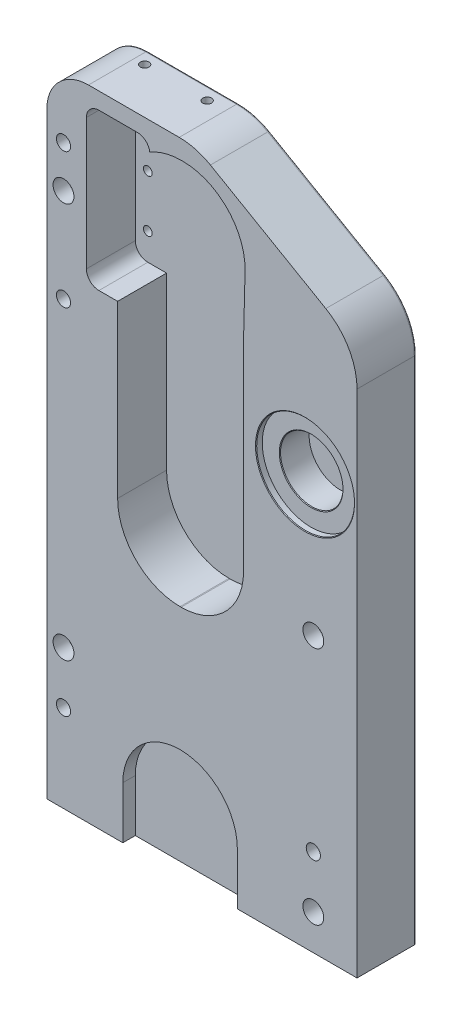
ISO-10303-21;
HEADER;
FILE_DESCRIPTION(('STEP AP214'),'2;1');
FILE_NAME('part.step','',(''),(''),'','','');
FILE_SCHEMA(('AUTOMOTIVE_DESIGN { 1 0 10303 214 1 1 1 1 }'));
ENDSEC;
DATA;
#1=APPLICATION_CONTEXT('core data for automotive mechanical design processes');
#2=APPLICATION_PROTOCOL_DEFINITION('international standard','automotive_design',2000,#1);
#3=PRODUCT_CONTEXT('',#1,'mechanical');
#4=PRODUCT('Part','Part','',(#3));
#5=PRODUCT_RELATED_PRODUCT_CATEGORY('part','',(#4));
#6=PRODUCT_DEFINITION_FORMATION('','',#4);
#7=PRODUCT_DEFINITION_CONTEXT('part definition',#1,'design');
#8=PRODUCT_DEFINITION('design','',#6,#7);
#9=PRODUCT_DEFINITION_SHAPE('','',#8);
#10=(LENGTH_UNIT() NAMED_UNIT(*) SI_UNIT(.MILLI.,.METRE.));
#11=(NAMED_UNIT(*) PLANE_ANGLE_UNIT() SI_UNIT($,.RADIAN.));
#12=(NAMED_UNIT(*) SI_UNIT($,.STERADIAN.) SOLID_ANGLE_UNIT());
#13=UNCERTAINTY_MEASURE_WITH_UNIT(LENGTH_MEASURE(1.E-05),#10,'distance_accuracy_value','');
#14=(GEOMETRIC_REPRESENTATION_CONTEXT(3) GLOBAL_UNCERTAINTY_ASSIGNED_CONTEXT((#13)) GLOBAL_UNIT_ASSIGNED_CONTEXT((#10,
#11,#12)) REPRESENTATION_CONTEXT('',''));
#15=CARTESIAN_POINT('',(0.,0.,0.));
#16=DIRECTION('',(0.,0.,1.));
#17=DIRECTION('',(1.,0.,0.));
#18=AXIS2_PLACEMENT_3D('',#15,#16,#17);
#19=CARTESIAN_POINT('',(-104.,90.,-28.5));
#20=DIRECTION('',(0.,0.,-1.));
#21=DIRECTION('',(-1.,0.,0.));
#22=AXIS2_PLACEMENT_3D('',#19,#20,#21);
#23=PLANE('',#22);
#24=CARTESIAN_POINT('',(0.,0.,-28.5));
#25=DIRECTION('',(0.,0.,-1.));
#26=DIRECTION('',(-1.,0.,0.));
#27=AXIS2_PLACEMENT_3D('',#24,#25,#26);
#28=CIRCLE('',#27,7.5);
#29=CARTESIAN_POINT('',(-7.5,0.,-28.5));
#30=VERTEX_POINT('',#29);
#31=EDGE_CURVE('E632',#30,#30,#28,.T.);
#32=ORIENTED_EDGE('',*,*,#31,.F.);
#33=EDGE_LOOP('',(#32));
#34=FACE_BOUND('',#33,.T.);
#35=CARTESIAN_POINT('',(4.00000000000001,-180.,-28.5));
#36=DIRECTION('',(0.,0.,1.));
#37=DIRECTION('',(1.,0.,0.));
#38=AXIS2_PLACEMENT_3D('',#35,#36,#37);
#39=CIRCLE('',#38,4.75);
#40=CARTESIAN_POINT('',(8.75,-180.,-28.5));
#41=VERTEX_POINT('',#40);
#42=EDGE_CURVE('E688',#41,#41,#39,.T.);
#43=ORIENTED_EDGE('',*,*,#42,.T.);
#44=EDGE_LOOP('',(#43));
#45=FACE_BOUND('',#44,.T.);
#46=CARTESIAN_POINT('',(-116.,60.,-28.5));
#47=DIRECTION('',(0.,0.,1.));
#48=DIRECTION('',(1.,0.,0.));
#49=AXIS2_PLACEMENT_3D('',#46,#47,#48);
#50=CIRCLE('',#49,4.74999999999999);
#51=CARTESIAN_POINT('',(-111.25,60.,-28.5));
#52=VERTEX_POINT('',#51);
#53=EDGE_CURVE('E691',#52,#52,#50,.T.);
#54=ORIENTED_EDGE('',*,*,#53,.T.);
#55=EDGE_LOOP('',(#54));
#56=FACE_BOUND('',#55,.T.);
#57=CARTESIAN_POINT('',(4.00000000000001,-65.,-28.5));
#58=DIRECTION('',(0.,0.,1.));
#59=DIRECTION('',(1.,0.,0.));
#60=AXIS2_PLACEMENT_3D('',#57,#58,#59);
#61=CIRCLE('',#60,4.75);
#62=CARTESIAN_POINT('',(8.75,-65.,-28.5));
#63=VERTEX_POINT('',#62);
#64=EDGE_CURVE('E694',#63,#63,#61,.T.);
#65=ORIENTED_EDGE('',*,*,#64,.T.);
#66=EDGE_LOOP('',(#65));
#67=FACE_BOUND('',#66,.T.);
#68=CARTESIAN_POINT('',(-116.,-130.,-28.5));
#69=DIRECTION('',(0.,0.,1.));
#70=DIRECTION('',(1.,0.,0.));
#71=AXIS2_PLACEMENT_3D('',#68,#69,#70);
#72=CIRCLE('',#71,4.74999999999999);
#73=CARTESIAN_POINT('',(-111.25,-130.,-28.5));
#74=VERTEX_POINT('',#73);
#75=EDGE_CURVE('E697',#74,#74,#72,.T.);
#76=ORIENTED_EDGE('',*,*,#75,.T.);
#77=EDGE_LOOP('',(#76));
#78=FACE_BOUND('',#77,.T.);
#79=CARTESIAN_POINT('',(-99.,90.,-28.5));
#80=DIRECTION('',(0.,0.,1.));
#81=DIRECTION('',(1.,0.,0.));
#82=AXIS2_PLACEMENT_3D('',#79,#80,#81);
#83=CIRCLE('',#82,2.1);
#84=CARTESIAN_POINT('',(-96.9,90.,-28.5));
#85=VERTEX_POINT('',#84);
#86=EDGE_CURVE('E703',#85,#85,#83,.T.);
#87=ORIENTED_EDGE('',*,*,#86,.T.);
#88=EDGE_LOOP('',(#87));
#89=FACE_BOUND('',#88,.T.);
#90=CARTESIAN_POINT('',(-99.,40.,-28.5));
#91=DIRECTION('',(0.,0.,1.));
#92=DIRECTION('',(1.,0.,0.));
#93=AXIS2_PLACEMENT_3D('',#90,#91,#92);
#94=CIRCLE('',#93,2.1);
#95=CARTESIAN_POINT('',(-96.9,40.,-28.5));
#96=VERTEX_POINT('',#95);
#97=EDGE_CURVE('E709',#96,#96,#94,.T.);
#98=ORIENTED_EDGE('',*,*,#97,.T.);
#99=EDGE_LOOP('',(#98));
#100=FACE_BOUND('',#99,.T.);
#101=CARTESIAN_POINT('',(-98.9999999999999,65.,-28.5));
#102=DIRECTION('',(0.,0.,1.));
#103=DIRECTION('',(1.,0.,0.));
#104=AXIS2_PLACEMENT_3D('',#101,#102,#103);
#105=CIRCLE('',#104,2.1);
#106=CARTESIAN_POINT('',(-96.8999999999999,65.,-28.5));
#107=VERTEX_POINT('',#106);
#108=EDGE_CURVE('E715',#107,#107,#105,.T.);
#109=ORIENTED_EDGE('',*,*,#108,.T.);
#110=EDGE_LOOP('',(#109));
#111=FACE_BOUND('',#110,.T.);
#112=CARTESIAN_POINT('',(-116.,-155.,-28.5));
#113=DIRECTION('',(0.,0.,1.));
#114=DIRECTION('',(1.,0.,0.));
#115=AXIS2_PLACEMENT_3D('',#112,#113,#114);
#116=CIRCLE('',#115,3.39999999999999);
#117=CARTESIAN_POINT('',(-112.6,-155.,-28.5));
#118=VERTEX_POINT('',#117);
#119=EDGE_CURVE('E820',#118,#118,#116,.T.);
#120=ORIENTED_EDGE('',*,*,#119,.T.);
#121=EDGE_LOOP('',(#120));
#122=FACE_BOUND('',#121,.T.);
#123=CARTESIAN_POINT('',(-116.,15.,-28.5));
#124=DIRECTION('',(0.,0.,1.));
#125=DIRECTION('',(1.,0.,0.));
#126=AXIS2_PLACEMENT_3D('',#123,#124,#125);
#127=CIRCLE('',#126,3.39999999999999);
#128=CARTESIAN_POINT('',(-112.6,15.,-28.5));
#129=VERTEX_POINT('',#128);
#130=EDGE_CURVE('E826',#129,#129,#127,.T.);
#131=ORIENTED_EDGE('',*,*,#130,.T.);
#132=EDGE_LOOP('',(#131));
#133=FACE_BOUND('',#132,.T.);
#134=CARTESIAN_POINT('',(-5.00000000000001,48.,-28.5));
#135=DIRECTION('',(0.,0.,-1.));
#136=DIRECTION('',(-1.,0.,0.));
#137=AXIS2_PLACEMENT_3D('',#134,#135,#136);
#138=CIRCLE('',#137,29.);
#139=CARTESIAN_POINT('',(9.50000000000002,73.1147367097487,-28.5));
#140=VERTEX_POINT('',#139);
#141=CARTESIAN_POINT('',(24.,48.,-28.5));
#142=VERTEX_POINT('',#141);
#143=EDGE_CURVE('E917',#140,#142,#138,.T.);
#144=ORIENTED_EDGE('',*,*,#143,.T.);
#145=DIRECTION('',(0.,1.,0.));
#146=VECTOR('',#145,1.);
#147=CARTESIAN_POINT('',(24.,90.,-28.5));
#148=LINE('',#147,#146);
#149=CARTESIAN_POINT('',(24.,-197.,-28.5));
#150=VERTEX_POINT('',#149);
#151=EDGE_CURVE('E919',#142,#150,#148,.F.);
#152=ORIENTED_EDGE('',*,*,#151,.T.);
#153=DIRECTION('',(1.,0.,0.));
#154=VECTOR('',#153,1.);
#155=CARTESIAN_POINT('',(-124.,-197.,-28.5));
#156=LINE('',#155,#154);
#157=CARTESIAN_POINT('',(-123.,-197.,-28.5));
#158=VERTEX_POINT('',#157);
#159=EDGE_CURVE('E877',#158,#150,#156,.T.);
#160=ORIENTED_EDGE('',*,*,#159,.F.);
#161=DIRECTION('',(0.,-1.,0.));
#162=VECTOR('',#161,1.);
#163=CARTESIAN_POINT('',(-123.,90.,-28.5));
#164=LINE('',#163,#162);
#165=CARTESIAN_POINT('',(-123.,90.,-28.5));
#166=VERTEX_POINT('',#165);
#167=EDGE_CURVE('E913',#158,#166,#164,.F.);
#168=ORIENTED_EDGE('',*,*,#167,.T.);
#169=CARTESIAN_POINT('',(-104.,90.,-28.5));
#170=DIRECTION('',(0.,0.,-1.));
#171=DIRECTION('',(-1.,0.,0.));
#172=AXIS2_PLACEMENT_3D('',#169,#170,#171);
#173=CIRCLE('',#172,19.);
#174=CARTESIAN_POINT('',(-104.,109.,-28.5));
#175=VERTEX_POINT('',#174);
#176=EDGE_CURVE('E909',#166,#175,#173,.T.);
#177=ORIENTED_EDGE('',*,*,#176,.T.);
#178=DIRECTION('',(-1.,0.,0.));
#179=VECTOR('',#178,1.);
#180=CARTESIAN_POINT('',(-104.,109.,-28.5));
#181=LINE('',#180,#179);
#182=CARTESIAN_POINT('',(-60.4256258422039,109.,-28.5));
#183=VERTEX_POINT('',#182);
#184=EDGE_CURVE('E907',#175,#183,#181,.F.);
#185=ORIENTED_EDGE('',*,*,#184,.T.);
#186=CARTESIAN_POINT('',(-60.4256258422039,80.,-28.5));
#187=DIRECTION('',(0.,0.,-1.));
#188=DIRECTION('',(-1.,0.,0.));
#189=AXIS2_PLACEMENT_3D('',#186,#187,#188);
#190=CIRCLE('',#189,29.);
#191=CARTESIAN_POINT('',(-45.9256258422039,105.114736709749,-28.5));
#192=VERTEX_POINT('',#191);
#193=EDGE_CURVE('E911',#183,#192,#190,.T.);
#194=ORIENTED_EDGE('',*,*,#193,.T.);
#195=DIRECTION('',(-0.866025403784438,0.500000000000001,0.));
#196=VECTOR('',#195,1.);
#197=CARTESIAN_POINT('',(-82.9365334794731,126.482994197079,-28.5));
#198=LINE('',#197,#196);
#199=EDGE_CURVE('E915',#192,#140,#198,.F.);
#200=ORIENTED_EDGE('',*,*,#199,.T.);
#201=EDGE_LOOP('',(#144,#152,#160,#168,#177,#185,#194,#200));
#202=FACE_BOUND('',#201,.T.);
#203=CARTESIAN_POINT('',(3.99999999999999,-155.,-28.5));
#204=DIRECTION('',(0.,0.,1.));
#205=DIRECTION('',(1.,0.,0.));
#206=AXIS2_PLACEMENT_3D('',#203,#204,#205);
#207=CIRCLE('',#206,3.39999999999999);
#208=CARTESIAN_POINT('',(7.39999999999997,-155.,-28.5));
#209=VERTEX_POINT('',#208);
#210=EDGE_CURVE('E823',#209,#209,#207,.T.);
#211=ORIENTED_EDGE('',*,*,#210,.T.);
#212=EDGE_LOOP('',(#211));
#213=FACE_BOUND('',#212,.T.);
#214=CARTESIAN_POINT('',(-116.,80.,-28.5));
#215=DIRECTION('',(0.,0.,1.));
#216=DIRECTION('',(1.,0.,0.));
#217=AXIS2_PLACEMENT_3D('',#214,#215,#216);
#218=CIRCLE('',#217,3.39999999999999);
#219=CARTESIAN_POINT('',(-112.6,80.,-28.5));
#220=VERTEX_POINT('',#219);
#221=EDGE_CURVE('E817',#220,#220,#218,.T.);
#222=ORIENTED_EDGE('',*,*,#221,.T.);
#223=EDGE_LOOP('',(#222));
#224=FACE_BOUND('',#223,.T.);
#225=ADVANCED_FACE('F348',(#34,#45,#56,#67,#78,#89,#100,#111,#122,#133,#202,#213,#224),#23,.T.);
#226=CARTESIAN_POINT('',(-104.,90.,0.));
#227=DIRECTION('',(0.,0.,-1.));
#228=DIRECTION('',(-1.,0.,0.));
#229=AXIS2_PLACEMENT_3D('',#226,#227,#228);
#230=PLANE('',#229);
#231=CARTESIAN_POINT('',(-116.,60.,0.));
#232=DIRECTION('',(0.,0.,1.));
#233=DIRECTION('',(1.,0.,0.));
#234=AXIS2_PLACEMENT_3D('',#231,#232,#233);
#235=CIRCLE('',#234,5.01);
#236=CARTESIAN_POINT('',(-110.99,60.,0.));
#237=VERTEX_POINT('',#236);
#238=EDGE_CURVE('E636',#237,#237,#235,.T.);
#239=ORIENTED_EDGE('',*,*,#238,.F.);
#240=EDGE_LOOP('',(#239));
#241=FACE_BOUND('',#240,.T.);
#242=CARTESIAN_POINT('',(-116.,-130.,0.));
#243=DIRECTION('',(0.,0.,1.));
#244=DIRECTION('',(1.,0.,0.));
#245=AXIS2_PLACEMENT_3D('',#242,#243,#244);
#246=CIRCLE('',#245,5.01);
#247=CARTESIAN_POINT('',(-110.99,-130.,0.));
#248=VERTEX_POINT('',#247);
#249=EDGE_CURVE('E643',#248,#248,#246,.T.);
#250=ORIENTED_EDGE('',*,*,#249,.F.);
#251=EDGE_LOOP('',(#250));
#252=FACE_BOUND('',#251,.T.);
#253=CARTESIAN_POINT('',(4.00000000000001,-180.,0.));
#254=DIRECTION('',(0.,0.,1.));
#255=DIRECTION('',(1.,0.,0.));
#256=AXIS2_PLACEMENT_3D('',#253,#254,#255);
#257=CIRCLE('',#256,5.01);
#258=CARTESIAN_POINT('',(9.01000000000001,-180.,0.));
#259=VERTEX_POINT('',#258);
#260=EDGE_CURVE('E650',#259,#259,#257,.T.);
#261=ORIENTED_EDGE('',*,*,#260,.F.);
#262=EDGE_LOOP('',(#261));
#263=FACE_BOUND('',#262,.T.);
#264=CARTESIAN_POINT('',(4.00000000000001,-65.,0.));
#265=DIRECTION('',(0.,0.,1.));
#266=DIRECTION('',(1.,0.,0.));
#267=AXIS2_PLACEMENT_3D('',#264,#265,#266);
#268=CIRCLE('',#267,5.01);
#269=CARTESIAN_POINT('',(9.01000000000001,-65.,0.));
#270=VERTEX_POINT('',#269);
#271=EDGE_CURVE('E657',#270,#270,#268,.T.);
#272=ORIENTED_EDGE('',*,*,#271,.F.);
#273=EDGE_LOOP('',(#272));
#274=FACE_BOUND('',#273,.T.);
#275=CARTESIAN_POINT('',(-60.,-55.,0.));
#276=DIRECTION('',(0.,0.,-1.));
#277=DIRECTION('',(-1.,0.,0.));
#278=AXIS2_PLACEMENT_3D('',#275,#276,#277);
#279=CIRCLE('',#278,30.);
#280=CARTESIAN_POINT('',(-60.,-85.,0.));
#281=VERTEX_POINT('',#280);
#282=CARTESIAN_POINT('',(-90.,-55.,0.));
#283=VERTEX_POINT('',#282);
#284=EDGE_CURVE('E811',#281,#283,#279,.T.);
#285=ORIENTED_EDGE('',*,*,#284,.T.);
#286=DIRECTION('',(0.,1.,0.));
#287=VECTOR('',#286,1.);
#288=CARTESIAN_POINT('',(-90.,90.,0.));
#289=LINE('',#288,#287);
#290=CARTESIAN_POINT('',(-90.,27.,0.));
#291=VERTEX_POINT('',#290);
#292=EDGE_CURVE('E814',#283,#291,#289,.T.);
#293=ORIENTED_EDGE('',*,*,#292,.T.);
#294=DIRECTION('',(-1.,0.,0.));
#295=VECTOR('',#294,1.);
#296=CARTESIAN_POINT('',(-104.,27.,0.));
#297=LINE('',#296,#295);
#298=CARTESIAN_POINT('',(-99.,27.,0.));
#299=VERTEX_POINT('',#298);
#300=EDGE_CURVE('E789',#291,#299,#297,.T.);
#301=ORIENTED_EDGE('',*,*,#300,.T.);
#302=CARTESIAN_POINT('',(-99.,33.,0.));
#303=DIRECTION('',(0.,0.,-1.));
#304=DIRECTION('',(-1.,0.,0.));
#305=AXIS2_PLACEMENT_3D('',#302,#303,#304);
#306=CIRCLE('',#305,6.00000000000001);
#307=CARTESIAN_POINT('',(-105.,33.,0.));
#308=VERTEX_POINT('',#307);
#309=EDGE_CURVE('E800',#299,#308,#306,.T.);
#310=ORIENTED_EDGE('',*,*,#309,.T.);
#311=DIRECTION('',(0.,1.,0.));
#312=VECTOR('',#311,1.);
#313=CARTESIAN_POINT('',(-105.,90.,0.));
#314=LINE('',#313,#312);
#315=CARTESIAN_POINT('',(-105.,96.,0.));
#316=VERTEX_POINT('',#315);
#317=EDGE_CURVE('E797',#308,#316,#314,.T.);
#318=ORIENTED_EDGE('',*,*,#317,.T.);
#319=CARTESIAN_POINT('',(-99.,96.,0.));
#320=DIRECTION('',(0.,0.,-1.));
#321=DIRECTION('',(-1.,0.,0.));
#322=AXIS2_PLACEMENT_3D('',#319,#320,#321);
#323=CIRCLE('',#322,6.00000000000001);
#324=CARTESIAN_POINT('',(-99.,102.,0.));
#325=VERTEX_POINT('',#324);
#326=EDGE_CURVE('E892',#316,#325,#323,.T.);
#327=ORIENTED_EDGE('',*,*,#326,.T.);
#328=DIRECTION('',(1.,0.,0.));
#329=VECTOR('',#328,1.);
#330=CARTESIAN_POINT('',(-104.,102.,0.));
#331=LINE('',#330,#329);
#332=CARTESIAN_POINT('',(-80.5,102.,0.));
#333=VERTEX_POINT('',#332);
#334=EDGE_CURVE('E1224',#325,#333,#331,.T.);
#335=ORIENTED_EDGE('',*,*,#334,.T.);
#336=CARTESIAN_POINT('',(-80.5,96.,0.));
#337=DIRECTION('',(0.,0.,-1.));
#338=DIRECTION('',(-1.,0.,0.));
#339=AXIS2_PLACEMENT_3D('',#336,#337,#338);
#340=CIRCLE('',#339,6.);
#341=CARTESIAN_POINT('',(-74.5478307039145,96.7560956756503,0.));
#342=VERTEX_POINT('',#341);
#343=EDGE_CURVE('E1225',#333,#342,#340,.T.);
#344=ORIENTED_EDGE('',*,*,#343,.T.);
#345=CARTESIAN_POINT('',(-59.278,70.933,0.));
#346=DIRECTION('',(0.,0.,-1.));
#347=DIRECTION('',(-1.,0.,0.));
#348=AXIS2_PLACEMENT_3D('',#345,#346,#347);
#349=CIRCLE('',#348,30.);
#350=CARTESIAN_POINT('',(-59.278,100.933,0.));
#351=VERTEX_POINT('',#350);
#352=EDGE_CURVE('E1227',#342,#351,#349,.T.);
#353=ORIENTED_EDGE('',*,*,#352,.T.);
#354=DIRECTION('',(1.,0.,0.));
#355=VECTOR('',#354,1.);
#356=CARTESIAN_POINT('',(-104.,100.933,0.));
#357=LINE('',#356,#355);
#358=CARTESIAN_POINT('',(-58.783,100.933,0.));
#359=VERTEX_POINT('',#358);
#360=EDGE_CURVE('E1232',#351,#359,#357,.T.);
#361=ORIENTED_EDGE('',*,*,#360,.T.);
#362=CARTESIAN_POINT('',(-58.783,70.933,0.));
#363=DIRECTION('',(0.,0.,-1.));
#364=DIRECTION('',(-1.,0.,0.));
#365=AXIS2_PLACEMENT_3D('',#362,#363,#364);
#366=CIRCLE('',#365,30.);
#367=CARTESIAN_POINT('',(-28.7923441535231,70.1842931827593,0.));
#368=VERTEX_POINT('',#367);
#369=EDGE_CURVE('E1235',#359,#368,#366,.T.);
#370=ORIENTED_EDGE('',*,*,#369,.T.);
#371=DIRECTION('',(-0.024956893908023,-0.999688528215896,0.));
#372=VECTOR('',#371,1.);
#373=CARTESIAN_POINT('',(-28.3448025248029,88.1112929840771,0.));
#374=LINE('',#373,#372);
#375=CARTESIAN_POINT('',(-29.5,41.838,0.));
#376=VERTEX_POINT('',#375);
#377=EDGE_CURVE('E1238',#368,#376,#374,.T.);
#378=ORIENTED_EDGE('',*,*,#377,.T.);
#379=DIRECTION('',(0.,-1.,0.));
#380=VECTOR('',#379,1.);
#381=CARTESIAN_POINT('',(-29.5,90.,0.));
#382=LINE('',#381,#380);
#383=CARTESIAN_POINT('',(-29.5,-55.,0.));
#384=VERTEX_POINT('',#383);
#385=EDGE_CURVE('E795',#376,#384,#382,.T.);
#386=ORIENTED_EDGE('',*,*,#385,.T.);
#387=CARTESIAN_POINT('',(-59.5,-55.,0.));
#388=DIRECTION('',(0.,0.,-1.));
#389=DIRECTION('',(-1.,0.,0.));
#390=AXIS2_PLACEMENT_3D('',#387,#388,#389);
#391=CIRCLE('',#390,30.);
#392=CARTESIAN_POINT('',(-59.5,-85.,0.));
#393=VERTEX_POINT('',#392);
#394=EDGE_CURVE('E792',#384,#393,#391,.T.);
#395=ORIENTED_EDGE('',*,*,#394,.T.);
#396=DIRECTION('',(-1.,0.,0.));
#397=VECTOR('',#396,1.);
#398=CARTESIAN_POINT('',(-104.,-85.,0.));
#399=LINE('',#398,#397);
#400=EDGE_CURVE('E748',#393,#281,#399,.T.);
#401=ORIENTED_EDGE('',*,*,#400,.T.);
#402=EDGE_LOOP('',(#285,#293,#301,#310,#318,#327,#335,#344,#353,#361,#370,#378,#386,#395,#401));
#403=FACE_BOUND('',#402,.T.);
#404=CARTESIAN_POINT('',(0.,0.,0.));
#405=DIRECTION('',(0.,0.,-1.));
#406=DIRECTION('',(-1.,0.,0.));
#407=AXIS2_PLACEMENT_3D('',#404,#405,#406);
#408=CIRCLE('',#407,23.8);
#409=CARTESIAN_POINT('',(-23.8,0.,0.));
#410=VERTEX_POINT('',#409);
#411=EDGE_CURVE('E1244',#410,#410,#408,.T.);
#412=ORIENTED_EDGE('',*,*,#411,.T.);
#413=EDGE_LOOP('',(#412));
#414=FACE_BOUND('',#413,.T.);
#415=DIRECTION('',(0.,-1.,0.));
#416=VECTOR('',#415,1.);
#417=CARTESIAN_POINT('',(-87.5,17.,0.));
#418=LINE('',#417,#416);
#419=CARTESIAN_POINT('',(-87.5,-172.,0.));
#420=VERTEX_POINT('',#419);
#421=CARTESIAN_POINT('',(-87.5,-197.,0.));
#422=VERTEX_POINT('',#421);
#423=EDGE_CURVE('E673',#420,#422,#418,.T.);
#424=ORIENTED_EDGE('',*,*,#423,.F.);
#425=CARTESIAN_POINT('',(-60.,-172.,0.));
#426=DIRECTION('',(0.,0.,-1.));
#427=DIRECTION('',(-1.,0.,0.));
#428=AXIS2_PLACEMENT_3D('',#425,#426,#427);
#429=CIRCLE('',#428,27.5);
#430=CARTESIAN_POINT('',(-32.5,-172.,0.));
#431=VERTEX_POINT('',#430);
#432=EDGE_CURVE('E851',#420,#431,#429,.T.);
#433=ORIENTED_EDGE('',*,*,#432,.T.);
#434=DIRECTION('',(0.,1.,0.));
#435=VECTOR('',#434,1.);
#436=CARTESIAN_POINT('',(-32.5,-38.7313579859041,0.));
#437=LINE('',#436,#435);
#438=CARTESIAN_POINT('',(-32.5,-197.,0.));
#439=VERTEX_POINT('',#438);
#440=EDGE_CURVE('E664',#439,#431,#437,.T.);
#441=ORIENTED_EDGE('',*,*,#440,.F.);
#442=DIRECTION('',(1.,0.,0.));
#443=VECTOR('',#442,1.);
#444=CARTESIAN_POINT('',(-124.,-197.,0.));
#445=LINE('',#444,#443);
#446=CARTESIAN_POINT('',(25.,-197.,0.));
#447=VERTEX_POINT('',#446);
#448=EDGE_CURVE('E666',#439,#447,#445,.T.);
#449=ORIENTED_EDGE('',*,*,#448,.T.);
#450=DIRECTION('',(0.,1.,0.));
#451=VECTOR('',#450,1.);
#452=CARTESIAN_POINT('',(25.,48.,0.));
#453=LINE('',#452,#451);
#454=CARTESIAN_POINT('',(25.,48.,0.));
#455=VERTEX_POINT('',#454);
#456=EDGE_CURVE('E859',#447,#455,#453,.T.);
#457=ORIENTED_EDGE('',*,*,#456,.T.);
#458=CARTESIAN_POINT('',(-5.00000000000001,48.,0.));
#459=DIRECTION('',(0.,0.,1.));
#460=DIRECTION('',(-1.,0.,0.));
#461=AXIS2_PLACEMENT_3D('',#458,#459,#460);
#462=CIRCLE('',#461,30.);
#463=CARTESIAN_POINT('',(10.,73.9807621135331,0.));
#464=VERTEX_POINT('',#463);
#465=EDGE_CURVE('E862',#455,#464,#462,.T.);
#466=ORIENTED_EDGE('',*,*,#465,.T.);
#467=DIRECTION('',(-0.866025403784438,0.500000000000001,0.));
#468=VECTOR('',#467,1.);
#469=CARTESIAN_POINT('',(-45.4256258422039,105.980762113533,0.));
#470=LINE('',#469,#468);
#471=CARTESIAN_POINT('',(-45.4256258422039,105.980762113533,0.));
#472=VERTEX_POINT('',#471);
#473=EDGE_CURVE('E865',#464,#472,#470,.T.);
#474=ORIENTED_EDGE('',*,*,#473,.T.);
#475=CARTESIAN_POINT('',(-60.4256258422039,80.,0.));
#476=DIRECTION('',(0.,0.,1.));
#477=DIRECTION('',(-1.,0.,0.));
#478=AXIS2_PLACEMENT_3D('',#475,#476,#477);
#479=CIRCLE('',#478,30.);
#480=CARTESIAN_POINT('',(-60.4256258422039,110.,0.));
#481=VERTEX_POINT('',#480);
#482=EDGE_CURVE('E868',#472,#481,#479,.T.);
#483=ORIENTED_EDGE('',*,*,#482,.T.);
#484=DIRECTION('',(-1.,0.,0.));
#485=VECTOR('',#484,1.);
#486=CARTESIAN_POINT('',(-104.,110.,0.));
#487=LINE('',#486,#485);
#488=CARTESIAN_POINT('',(-104.,110.,0.));
#489=VERTEX_POINT('',#488);
#490=EDGE_CURVE('E871',#481,#489,#487,.T.);
#491=ORIENTED_EDGE('',*,*,#490,.T.);
#492=CARTESIAN_POINT('',(-104.,90.,0.));
#493=DIRECTION('',(0.,0.,1.));
#494=DIRECTION('',(-1.,0.,0.));
#495=AXIS2_PLACEMENT_3D('',#492,#493,#494);
#496=CIRCLE('',#495,20.);
#497=CARTESIAN_POINT('',(-124.,90.,0.));
#498=VERTEX_POINT('',#497);
#499=EDGE_CURVE('E874',#489,#498,#496,.T.);
#500=ORIENTED_EDGE('',*,*,#499,.T.);
#501=DIRECTION('',(0.,-1.,0.));
#502=VECTOR('',#501,1.);
#503=CARTESIAN_POINT('',(-124.,-197.,0.));
#504=LINE('',#503,#502);
#505=CARTESIAN_POINT('',(-124.,-197.,0.));
#506=VERTEX_POINT('',#505);
#507=EDGE_CURVE('E669',#498,#506,#504,.T.);
#508=ORIENTED_EDGE('',*,*,#507,.T.);
#509=EDGE_CURVE('E670',#506,#422,#445,.T.);
#510=ORIENTED_EDGE('',*,*,#509,.T.);
#511=EDGE_LOOP('',(#424,#433,#441,#449,#457,#466,#474,#483,#491,#500,#508,#510));
#512=FACE_BOUND('',#511,.T.);
#513=CARTESIAN_POINT('',(3.99999999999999,-155.,0.));
#514=DIRECTION('',(0.,0.,-1.));
#515=DIRECTION('',(-1.,0.,0.));
#516=AXIS2_PLACEMENT_3D('',#513,#514,#515);
#517=CIRCLE('',#516,3.39999999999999);
#518=CARTESIAN_POINT('',(0.599999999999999,-155.,0.));
#519=VERTEX_POINT('',#518);
#520=EDGE_CURVE('E682',#519,#519,#517,.F.);
#521=ORIENTED_EDGE('',*,*,#520,.F.);
#522=EDGE_LOOP('',(#521));
#523=FACE_BOUND('',#522,.T.);
#524=CARTESIAN_POINT('',(-116.,15.,0.));
#525=DIRECTION('',(0.,0.,-1.));
#526=DIRECTION('',(-1.,0.,0.));
#527=AXIS2_PLACEMENT_3D('',#524,#525,#526);
#528=CIRCLE('',#527,3.39999999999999);
#529=CARTESIAN_POINT('',(-119.4,15.,0.));
#530=VERTEX_POINT('',#529);
#531=EDGE_CURVE('E685',#530,#530,#528,.F.);
#532=ORIENTED_EDGE('',*,*,#531,.F.);
#533=EDGE_LOOP('',(#532));
#534=FACE_BOUND('',#533,.T.);
#535=CARTESIAN_POINT('',(-116.,80.,0.));
#536=DIRECTION('',(0.,0.,-1.));
#537=DIRECTION('',(-1.,0.,0.));
#538=AXIS2_PLACEMENT_3D('',#535,#536,#537);
#539=CIRCLE('',#538,3.39999999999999);
#540=CARTESIAN_POINT('',(-119.4,80.,0.));
#541=VERTEX_POINT('',#540);
#542=EDGE_CURVE('E676',#541,#541,#539,.F.);
#543=ORIENTED_EDGE('',*,*,#542,.F.);
#544=EDGE_LOOP('',(#543));
#545=FACE_BOUND('',#544,.T.);
#546=CARTESIAN_POINT('',(-116.,-155.,0.));
#547=DIRECTION('',(0.,0.,-1.));
#548=DIRECTION('',(-1.,0.,0.));
#549=AXIS2_PLACEMENT_3D('',#546,#547,#548);
#550=CIRCLE('',#549,3.39999999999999);
#551=CARTESIAN_POINT('',(-119.4,-155.,0.));
#552=VERTEX_POINT('',#551);
#553=EDGE_CURVE('E679',#552,#552,#550,.F.);
#554=ORIENTED_EDGE('',*,*,#553,.F.);
#555=EDGE_LOOP('',(#554));
#556=FACE_BOUND('',#555,.T.);
#557=ADVANCED_FACE('F1089',(#241,#252,#263,#274,#403,#414,#512,#523,#534,#545,#556),#230,.F.);
#558=CARTESIAN_POINT('',(25.,48.,-28.5));
#559=DIRECTION('',(1.,0.,0.));
#560=DIRECTION('',(0.,1.,0.));
#561=AXIS2_PLACEMENT_3D('',#558,#559,#560);
#562=PLANE('',#561);
#563=DIRECTION('',(0.,0.,1.));
#564=VECTOR('',#563,1.);
#565=CARTESIAN_POINT('',(25.,-197.,-28.5));
#566=LINE('',#565,#564);
#567=CARTESIAN_POINT('',(25.,-197.,-27.5));
#568=VERTEX_POINT('',#567);
#569=EDGE_CURVE('E1153',#568,#447,#566,.T.);
#570=ORIENTED_EDGE('',*,*,#569,.F.);
#571=DIRECTION('',(0.,1.,0.));
#572=VECTOR('',#571,1.);
#573=CARTESIAN_POINT('',(25.,48.,-27.5));
#574=LINE('',#573,#572);
#575=CARTESIAN_POINT('',(25.,48.,-27.5));
#576=VERTEX_POINT('',#575);
#577=EDGE_CURVE('E904',#568,#576,#574,.T.);
#578=ORIENTED_EDGE('',*,*,#577,.T.);
#579=DIRECTION('',(0.,0.,1.));
#580=VECTOR('',#579,1.);
#581=CARTESIAN_POINT('',(25.,48.,-28.5));
#582=LINE('',#581,#580);
#583=EDGE_CURVE('E883',#576,#455,#582,.T.);
#584=ORIENTED_EDGE('',*,*,#583,.T.);
#585=ORIENTED_EDGE('',*,*,#456,.F.);
#586=EDGE_LOOP('',(#570,#578,#584,#585));
#587=FACE_BOUND('',#586,.T.);
#588=ADVANCED_FACE('F350',(#587),#562,.T.);
#589=CARTESIAN_POINT('',(-124.,-197.,-28.5));
#590=DIRECTION('',(0.,-1.,0.));
#591=DIRECTION('',(0.,0.,-1.));
#592=AXIS2_PLACEMENT_3D('',#589,#590,#591);
#593=PLANE('',#592);
#594=ORIENTED_EDGE('',*,*,#159,.T.);
#595=CARTESIAN_POINT('',(24.,-197.,-27.5));
#596=DIRECTION('',(0.,-1.,0.));
#597=DIRECTION('',(0.,0.,-1.));
#598=AXIS2_PLACEMENT_3D('',#595,#596,#597);
#599=CIRCLE('',#598,1.);
#600=EDGE_CURVE('E923',#150,#568,#599,.T.);
#601=ORIENTED_EDGE('',*,*,#600,.T.);
#602=ORIENTED_EDGE('',*,*,#569,.T.);
#603=ORIENTED_EDGE('',*,*,#448,.F.);
#604=DIRECTION('',(0.,0.,-1.));
#605=VECTOR('',#604,1.);
#606=CARTESIAN_POINT('',(-32.5,-197.,24.));
#607=LINE('',#606,#605);
#608=CARTESIAN_POINT('',(-32.5,-197.,-6.));
#609=VERTEX_POINT('',#608);
#610=EDGE_CURVE('E856',#439,#609,#607,.T.);
#611=ORIENTED_EDGE('',*,*,#610,.T.);
#612=DIRECTION('',(1.,0.,0.));
#613=VECTOR('',#612,1.);
#614=CARTESIAN_POINT('',(-87.5,-197.,-6.));
#615=LINE('',#614,#613);
#616=CARTESIAN_POINT('',(-87.5,-197.,-6.));
#617=VERTEX_POINT('',#616);
#618=EDGE_CURVE('E835',#617,#609,#615,.T.);
#619=ORIENTED_EDGE('',*,*,#618,.F.);
#620=DIRECTION('',(0.,0.,-1.));
#621=VECTOR('',#620,1.);
#622=CARTESIAN_POINT('',(-87.5,-197.,24.));
#623=LINE('',#622,#621);
#624=EDGE_CURVE('E858',#422,#617,#623,.T.);
#625=ORIENTED_EDGE('',*,*,#624,.F.);
#626=ORIENTED_EDGE('',*,*,#509,.F.);
#627=DIRECTION('',(0.,0.,1.));
#628=VECTOR('',#627,1.);
#629=CARTESIAN_POINT('',(-124.,-197.,-28.5));
#630=LINE('',#629,#628);
#631=CARTESIAN_POINT('',(-124.,-197.,-27.5));
#632=VERTEX_POINT('',#631);
#633=EDGE_CURVE('E1155',#632,#506,#630,.T.);
#634=ORIENTED_EDGE('',*,*,#633,.F.);
#635=CARTESIAN_POINT('',(-123.,-197.,-27.5));
#636=DIRECTION('',(0.,-1.,0.));
#637=DIRECTION('',(0.,0.,-1.));
#638=AXIS2_PLACEMENT_3D('',#635,#636,#637);
#639=CIRCLE('',#638,1.);
#640=EDGE_CURVE('E921',#632,#158,#639,.T.);
#641=ORIENTED_EDGE('',*,*,#640,.T.);
#642=EDGE_LOOP('',(#594,#601,#602,#603,#611,#619,#625,#626,#634,#641));
#643=FACE_BOUND('',#642,.T.);
#644=ADVANCED_FACE('F1102',(#643),#593,.T.);
#645=CARTESIAN_POINT('',(-124.,-197.,-28.5));
#646=DIRECTION('',(-1.,0.,0.));
#647=DIRECTION('',(0.,-1.,0.));
#648=AXIS2_PLACEMENT_3D('',#645,#646,#647);
#649=PLANE('',#648);
#650=DIRECTION('',(0.,0.,1.));
#651=VECTOR('',#650,1.);
#652=CARTESIAN_POINT('',(-124.,90.,-28.5));
#653=LINE('',#652,#651);
#654=CARTESIAN_POINT('',(-124.,90.,-27.5));
#655=VERTEX_POINT('',#654);
#656=EDGE_CURVE('E1158',#655,#498,#653,.T.);
#657=ORIENTED_EDGE('',*,*,#656,.F.);
#658=DIRECTION('',(0.,-1.,0.));
#659=VECTOR('',#658,1.);
#660=CARTESIAN_POINT('',(-124.,-197.,-27.5));
#661=LINE('',#660,#659);
#662=EDGE_CURVE('E929',#655,#632,#661,.T.);
#663=ORIENTED_EDGE('',*,*,#662,.T.);
#664=ORIENTED_EDGE('',*,*,#633,.T.);
#665=ORIENTED_EDGE('',*,*,#507,.F.);
#666=EDGE_LOOP('',(#657,#663,#664,#665));
#667=FACE_BOUND('',#666,.T.);
#668=ADVANCED_FACE('F1105',(#667),#649,.T.);
#669=CARTESIAN_POINT('',(-104.,90.,-28.5));
#670=DIRECTION('',(0.,0.,1.));
#671=DIRECTION('',(1.,0.,0.));
#672=AXIS2_PLACEMENT_3D('',#669,#670,#671);
#673=CYLINDRICAL_SURFACE('',#672,20.);
#674=DIRECTION('',(0.,0.,1.));
#675=VECTOR('',#674,1.);
#676=CARTESIAN_POINT('',(-104.,110.,-28.5));
#677=LINE('',#676,#675);
#678=CARTESIAN_POINT('',(-104.,110.,-27.5));
#679=VERTEX_POINT('',#678);
#680=EDGE_CURVE('E1162',#679,#489,#677,.T.);
#681=ORIENTED_EDGE('',*,*,#680,.F.);
#682=CARTESIAN_POINT('',(-104.,90.,-27.5));
#683=DIRECTION('',(0.,0.,-1.));
#684=DIRECTION('',(-1.,0.,0.));
#685=AXIS2_PLACEMENT_3D('',#682,#683,#684);
#686=CIRCLE('',#685,20.);
#687=EDGE_CURVE('E933',#679,#655,#686,.F.);
#688=ORIENTED_EDGE('',*,*,#687,.T.);
#689=ORIENTED_EDGE('',*,*,#656,.T.);
#690=ORIENTED_EDGE('',*,*,#499,.F.);
#691=EDGE_LOOP('',(#681,#688,#689,#690));
#692=FACE_BOUND('',#691,.T.);
#693=ADVANCED_FACE('F1109',(#692),#673,.T.);
#694=CARTESIAN_POINT('',(-104.,110.,-28.5));
#695=DIRECTION('',(0.,1.,0.));
#696=DIRECTION('',(-1.,0.,0.));
#697=AXIS2_PLACEMENT_3D('',#694,#695,#696);
#698=PLANE('',#697);
#699=CARTESIAN_POINT('',(-99.,110.,-22.));
#700=DIRECTION('',(0.,1.,0.));
#701=DIRECTION('',(0.,0.,1.));
#702=AXIS2_PLACEMENT_3D('',#699,#700,#701);
#703=CIRCLE('',#702,2.1);
#704=CARTESIAN_POINT('',(-99.,110.,-19.9));
#705=VERTEX_POINT('',#704);
#706=EDGE_CURVE('E588',#705,#705,#703,.T.);
#707=ORIENTED_EDGE('',*,*,#706,.F.);
#708=EDGE_LOOP('',(#707));
#709=FACE_BOUND('',#708,.T.);
#710=CARTESIAN_POINT('',(-69.,110.,-22.));
#711=DIRECTION('',(0.,1.,0.));
#712=DIRECTION('',(0.,0.,1.));
#713=AXIS2_PLACEMENT_3D('',#710,#711,#712);
#714=CIRCLE('',#713,2.1);
#715=CARTESIAN_POINT('',(-69.,110.,-19.9));
#716=VERTEX_POINT('',#715);
#717=EDGE_CURVE('E598',#716,#716,#714,.T.);
#718=ORIENTED_EDGE('',*,*,#717,.F.);
#719=EDGE_LOOP('',(#718));
#720=FACE_BOUND('',#719,.T.);
#721=DIRECTION('',(0.,0.,1.));
#722=VECTOR('',#721,1.);
#723=CARTESIAN_POINT('',(-60.4256258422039,110.,-28.5));
#724=LINE('',#723,#722);
#725=CARTESIAN_POINT('',(-60.4256258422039,110.,-27.5));
#726=VERTEX_POINT('',#725);
#727=EDGE_CURVE('E1164',#726,#481,#724,.T.);
#728=ORIENTED_EDGE('',*,*,#727,.F.);
#729=DIRECTION('',(-1.,0.,0.));
#730=VECTOR('',#729,1.);
#731=CARTESIAN_POINT('',(-104.,110.,-27.5));
#732=LINE('',#731,#730);
#733=EDGE_CURVE('E935',#726,#679,#732,.T.);
#734=ORIENTED_EDGE('',*,*,#733,.T.);
#735=ORIENTED_EDGE('',*,*,#680,.T.);
#736=ORIENTED_EDGE('',*,*,#490,.F.);
#737=EDGE_LOOP('',(#728,#734,#735,#736));
#738=FACE_BOUND('',#737,.T.);
#739=ADVANCED_FACE('F1113',(#709,#720,#738),#698,.T.);
#740=CARTESIAN_POINT('',(-60.4256258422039,80.,-28.5));
#741=DIRECTION('',(0.,0.,1.));
#742=DIRECTION('',(1.,0.,0.));
#743=AXIS2_PLACEMENT_3D('',#740,#741,#742);
#744=CYLINDRICAL_SURFACE('',#743,30.);
#745=DIRECTION('',(0.,0.,1.));
#746=VECTOR('',#745,1.);
#747=CARTESIAN_POINT('',(-45.4256258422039,105.980762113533,-28.5));
#748=LINE('',#747,#746);
#749=CARTESIAN_POINT('',(-45.4256258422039,105.980762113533,-27.5));
#750=VERTEX_POINT('',#749);
#751=EDGE_CURVE('E1141',#750,#472,#748,.T.);
#752=ORIENTED_EDGE('',*,*,#751,.F.);
#753=CARTESIAN_POINT('',(-60.4256258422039,80.,-27.5));
#754=DIRECTION('',(0.,0.,-1.));
#755=DIRECTION('',(-1.,0.,0.));
#756=AXIS2_PLACEMENT_3D('',#753,#754,#755);
#757=CIRCLE('',#756,30.);
#758=EDGE_CURVE('E931',#750,#726,#757,.F.);
#759=ORIENTED_EDGE('',*,*,#758,.T.);
#760=ORIENTED_EDGE('',*,*,#727,.T.);
#761=ORIENTED_EDGE('',*,*,#482,.F.);
#762=EDGE_LOOP('',(#752,#759,#760,#761));
#763=FACE_BOUND('',#762,.T.);
#764=ADVANCED_FACE('F1117',(#763),#744,.T.);
#765=CARTESIAN_POINT('',(-45.4256258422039,105.980762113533,-28.5));
#766=DIRECTION('',(0.500000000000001,0.866025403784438,0.));
#767=DIRECTION('',(-0.866025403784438,0.500000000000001,0.));
#768=AXIS2_PLACEMENT_3D('',#765,#766,#767);
#769=PLANE('',#768);
#770=DIRECTION('',(0.,0.,1.));
#771=VECTOR('',#770,1.);
#772=CARTESIAN_POINT('',(10.,73.9807621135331,-28.5));
#773=LINE('',#772,#771);
#774=CARTESIAN_POINT('',(10.,73.9807621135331,-27.5));
#775=VERTEX_POINT('',#774);
#776=EDGE_CURVE('E1140',#775,#464,#773,.T.);
#777=ORIENTED_EDGE('',*,*,#776,.F.);
#778=DIRECTION('',(-0.866025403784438,0.500000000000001,0.));
#779=VECTOR('',#778,1.);
#780=CARTESIAN_POINT('',(-45.4256258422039,105.980762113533,-27.5));
#781=LINE('',#780,#779);
#782=EDGE_CURVE('E927',#775,#750,#781,.T.);
#783=ORIENTED_EDGE('',*,*,#782,.T.);
#784=ORIENTED_EDGE('',*,*,#751,.T.);
#785=ORIENTED_EDGE('',*,*,#473,.F.);
#786=EDGE_LOOP('',(#777,#783,#784,#785));
#787=FACE_BOUND('',#786,.T.);
#788=ADVANCED_FACE('F1121',(#787),#769,.T.);
#789=CARTESIAN_POINT('',(-5.00000000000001,48.,-28.5));
#790=DIRECTION('',(0.,0.,1.));
#791=DIRECTION('',(1.,0.,0.));
#792=AXIS2_PLACEMENT_3D('',#789,#790,#791);
#793=CYLINDRICAL_SURFACE('',#792,30.);
#794=ORIENTED_EDGE('',*,*,#583,.F.);
#795=CARTESIAN_POINT('',(-5.00000000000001,48.,-27.5));
#796=DIRECTION('',(0.,0.,-1.));
#797=DIRECTION('',(-1.,0.,0.));
#798=AXIS2_PLACEMENT_3D('',#795,#796,#797);
#799=CIRCLE('',#798,30.);
#800=EDGE_CURVE('E925',#576,#775,#799,.F.);
#801=ORIENTED_EDGE('',*,*,#800,.T.);
#802=ORIENTED_EDGE('',*,*,#776,.T.);
#803=ORIENTED_EDGE('',*,*,#465,.F.);
#804=EDGE_LOOP('',(#794,#801,#802,#803));
#805=FACE_BOUND('',#804,.T.);
#806=ADVANCED_FACE('F1124',(#805),#793,.T.);
#807=CARTESIAN_POINT('',(-87.5,17.,24.));
#808=DIRECTION('',(-1.,0.,0.));
#809=DIRECTION('',(0.,-1.,0.));
#810=AXIS2_PLACEMENT_3D('',#807,#808,#809);
#811=PLANE('',#810);
#812=DIRECTION('',(0.,0.,1.));
#813=VECTOR('',#812,1.);
#814=CARTESIAN_POINT('',(-87.5,-172.,-6.));
#815=LINE('',#814,#813);
#816=CARTESIAN_POINT('',(-87.5,-172.,-6.));
#817=VERTEX_POINT('',#816);
#818=EDGE_CURVE('E848',#817,#420,#815,.T.);
#819=ORIENTED_EDGE('',*,*,#818,.T.);
#820=ORIENTED_EDGE('',*,*,#423,.T.);
#821=ORIENTED_EDGE('',*,*,#624,.T.);
#822=DIRECTION('',(0.,-1.,0.));
#823=VECTOR('',#822,1.);
#824=CARTESIAN_POINT('',(-87.5,-197.,-6.));
#825=LINE('',#824,#823);
#826=EDGE_CURVE('E844',#817,#617,#825,.T.);
#827=ORIENTED_EDGE('',*,*,#826,.F.);
#828=EDGE_LOOP('',(#819,#820,#821,#827));
#829=FACE_BOUND('',#828,.T.);
#830=ADVANCED_FACE('F1127',(#829),#811,.F.);
#831=CARTESIAN_POINT('',(-105.,69.3431457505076,24.));
#832=DIRECTION('',(-1.,0.,0.));
#833=DIRECTION('',(0.,-1.,0.));
#834=AXIS2_PLACEMENT_3D('',#831,#832,#833);
#835=PLANE('',#834);
#836=ORIENTED_EDGE('',*,*,#317,.F.);
#837=DIRECTION('',(0.,0.,1.));
#838=VECTOR('',#837,1.);
#839=CARTESIAN_POINT('',(-105.,33.,-225.435710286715));
#840=LINE('',#839,#838);
#841=CARTESIAN_POINT('',(-105.,33.,-23.5));
#842=VERTEX_POINT('',#841);
#843=EDGE_CURVE('E754',#842,#308,#840,.T.);
#844=ORIENTED_EDGE('',*,*,#843,.F.);
#845=DIRECTION('',(0.,1.,0.));
#846=VECTOR('',#845,1.);
#847=CARTESIAN_POINT('',(-105.,33.,-23.5));
#848=LINE('',#847,#846);
#849=CARTESIAN_POINT('',(-105.,96.,-23.5));
#850=VERTEX_POINT('',#849);
#851=EDGE_CURVE('E742',#842,#850,#848,.T.);
#852=ORIENTED_EDGE('',*,*,#851,.T.);
#853=DIRECTION('',(0.,0.,1.));
#854=VECTOR('',#853,1.);
#855=CARTESIAN_POINT('',(-105.,96.,-225.435710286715));
#856=LINE('',#855,#854);
#857=EDGE_CURVE('E757',#850,#316,#856,.T.);
#858=ORIENTED_EDGE('',*,*,#857,.T.);
#859=EDGE_LOOP('',(#836,#844,#852,#858));
#860=FACE_BOUND('',#859,.T.);
#861=ADVANCED_FACE('F1132',(#860),#835,.F.);
#862=CARTESIAN_POINT('',(-32.5,-38.7313579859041,24.));
#863=DIRECTION('',(1.,0.,0.));
#864=DIRECTION('',(0.,1.,0.));
#865=AXIS2_PLACEMENT_3D('',#862,#863,#864);
#866=PLANE('',#865);
#867=ORIENTED_EDGE('',*,*,#610,.F.);
#868=ORIENTED_EDGE('',*,*,#440,.T.);
#869=DIRECTION('',(0.,0.,1.));
#870=VECTOR('',#869,1.);
#871=CARTESIAN_POINT('',(-32.5,-172.,-6.));
#872=LINE('',#871,#870);
#873=CARTESIAN_POINT('',(-32.5,-172.,-6.));
#874=VERTEX_POINT('',#873);
#875=EDGE_CURVE('E847',#874,#431,#872,.T.);
#876=ORIENTED_EDGE('',*,*,#875,.F.);
#877=DIRECTION('',(0.,1.,0.));
#878=VECTOR('',#877,1.);
#879=CARTESIAN_POINT('',(-32.5,-172.,-6.));
#880=LINE('',#879,#878);
#881=EDGE_CURVE('E838',#609,#874,#880,.T.);
#882=ORIENTED_EDGE('',*,*,#881,.F.);
#883=EDGE_LOOP('',(#867,#868,#876,#882));
#884=FACE_BOUND('',#883,.T.);
#885=ADVANCED_FACE('F1179',(#884),#866,.F.);
#886=CARTESIAN_POINT('',(-60.,-172.,-6.));
#887=DIRECTION('',(0.,0.,1.));
#888=DIRECTION('',(1.,0.,0.));
#889=AXIS2_PLACEMENT_3D('',#886,#887,#888);
#890=CYLINDRICAL_SURFACE('',#889,27.5);
#891=ORIENTED_EDGE('',*,*,#818,.F.);
#892=CARTESIAN_POINT('',(-60.,-172.,-6.));
#893=DIRECTION('',(0.,0.,1.));
#894=DIRECTION('',(1.,0.,0.));
#895=AXIS2_PLACEMENT_3D('',#892,#893,#894);
#896=CIRCLE('',#895,27.5);
#897=EDGE_CURVE('E841',#874,#817,#896,.T.);
#898=ORIENTED_EDGE('',*,*,#897,.F.);
#899=ORIENTED_EDGE('',*,*,#875,.T.);
#900=ORIENTED_EDGE('',*,*,#432,.F.);
#901=EDGE_LOOP('',(#891,#898,#899,#900));
#902=FACE_BOUND('',#901,.T.);
#903=ADVANCED_FACE('F1188',(#902),#890,.F.);
#904=CARTESIAN_POINT('',(-60.,-172.,-6.));
#905=DIRECTION('',(0.,0.,1.));
#906=DIRECTION('',(1.,0.,0.));
#907=AXIS2_PLACEMENT_3D('',#904,#905,#906);
#908=PLANE('',#907);
#909=ORIENTED_EDGE('',*,*,#618,.T.);
#910=ORIENTED_EDGE('',*,*,#881,.T.);
#911=ORIENTED_EDGE('',*,*,#897,.T.);
#912=ORIENTED_EDGE('',*,*,#826,.T.);
#913=EDGE_LOOP('',(#909,#910,#911,#912));
#914=FACE_BOUND('',#913,.T.);
#915=ADVANCED_FACE('F1182',(#914),#908,.T.);
#916=CARTESIAN_POINT('',(0.,0.,24.));
#917=DIRECTION('',(0.,0.,1.));
#918=DIRECTION('',(1.,0.,0.));
#919=AXIS2_PLACEMENT_3D('',#916,#917,#918);
#920=CYLINDRICAL_SURFACE('',#919,23.5);
#921=CARTESIAN_POINT('',(0.,0.,-0.300000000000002));
#922=DIRECTION('',(0.,0.,-1.));
#923=DIRECTION('',(-1.,0.,0.));
#924=AXIS2_PLACEMENT_3D('',#921,#922,#923);
#925=CIRCLE('',#924,23.5);
#926=CARTESIAN_POINT('',(-23.5,0.,-0.300000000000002));
#927=VERTEX_POINT('',#926);
#928=EDGE_CURVE('E1241',#927,#927,#925,.F.);
#929=ORIENTED_EDGE('',*,*,#928,.T.);
#930=EDGE_LOOP('',(#929));
#931=FACE_BOUND('',#930,.T.);
#932=CARTESIAN_POINT('',(0.,0.,-2.95));
#933=DIRECTION('',(0.,0.,1.));
#934=DIRECTION('',(1.,0.,0.));
#935=AXIS2_PLACEMENT_3D('',#932,#933,#934);
#936=CIRCLE('',#935,23.5);
#937=CARTESIAN_POINT('',(23.5,0.,-2.95));
#938=VERTEX_POINT('',#937);
#939=EDGE_CURVE('E832',#938,#938,#936,.T.);
#940=ORIENTED_EDGE('',*,*,#939,.F.);
#941=EDGE_LOOP('',(#940));
#942=FACE_BOUND('',#941,.T.);
#943=ADVANCED_FACE('F1196',(#931,#942),#920,.F.);
#944=CARTESIAN_POINT('',(15.,0.,-2.95));
#945=DIRECTION('',(0.,0.,-1.));
#946=DIRECTION('',(-1.,0.,0.));
#947=AXIS2_PLACEMENT_3D('',#944,#945,#946);
#948=PLANE('',#947);
#949=CARTESIAN_POINT('',(0.,0.,-2.95));
#950=DIRECTION('',(0.,0.,-1.));
#951=DIRECTION('',(-1.,0.,0.));
#952=AXIS2_PLACEMENT_3D('',#949,#950,#951);
#953=CIRCLE('',#952,15.3);
#954=CARTESIAN_POINT('',(-15.3,0.,-2.95));
#955=VERTEX_POINT('',#954);
#956=EDGE_CURVE('E1157',#955,#955,#953,.T.);
#957=ORIENTED_EDGE('',*,*,#956,.T.);
#958=EDGE_LOOP('',(#957));
#959=FACE_BOUND('',#958,.T.);
#960=ORIENTED_EDGE('',*,*,#939,.T.);
#961=EDGE_LOOP('',(#960));
#962=FACE_BOUND('',#961,.T.);
#963=ADVANCED_FACE('F1249',(#959,#962),#948,.F.);
#964=CARTESIAN_POINT('',(0.,0.,24.));
#965=DIRECTION('',(0.,0.,1.));
#966=DIRECTION('',(1.,0.,0.));
#967=AXIS2_PLACEMENT_3D('',#964,#965,#966);
#968=CYLINDRICAL_SURFACE('',#967,15.);
#969=CARTESIAN_POINT('',(0.,0.,-3.25));
#970=DIRECTION('',(0.,0.,-1.));
#971=DIRECTION('',(-1.,0.,0.));
#972=AXIS2_PLACEMENT_3D('',#969,#970,#971);
#973=CIRCLE('',#972,15.);
#974=CARTESIAN_POINT('',(-15.,0.,-3.25));
#975=VERTEX_POINT('',#974);
#976=EDGE_CURVE('E887',#975,#975,#973,.F.);
#977=ORIENTED_EDGE('',*,*,#976,.T.);
#978=EDGE_LOOP('',(#977));
#979=FACE_BOUND('',#978,.T.);
#980=CARTESIAN_POINT('',(0.,0.,-17.));
#981=DIRECTION('',(0.,0.,1.));
#982=DIRECTION('',(1.,0.,0.));
#983=AXIS2_PLACEMENT_3D('',#980,#981,#982);
#984=CIRCLE('',#983,15.);
#985=CARTESIAN_POINT('',(15.,0.,-17.));
#986=VERTEX_POINT('',#985);
#987=EDGE_CURVE('E829',#986,#986,#984,.T.);
#988=ORIENTED_EDGE('',*,*,#987,.F.);
#989=EDGE_LOOP('',(#988));
#990=FACE_BOUND('',#989,.T.);
#991=ADVANCED_FACE('F1260',(#979,#990),#968,.F.);
#992=CARTESIAN_POINT('',(0.,0.,-17.));
#993=DIRECTION('',(0.,0.,-1.));
#994=DIRECTION('',(-1.,0.,0.));
#995=AXIS2_PLACEMENT_3D('',#992,#993,#994);
#996=PLANE('',#995);
#997=CARTESIAN_POINT('',(0.,0.,-17.));
#998=DIRECTION('',(0.,0.,-1.));
#999=DIRECTION('',(-1.,0.,0.));
#1000=AXIS2_PLACEMENT_3D('',#997,#998,#999);
#1001=CIRCLE('',#1000,4.20000000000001);
#1002=CARTESIAN_POINT('',(-4.20000000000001,0.,-17.));
#1003=VERTEX_POINT('',#1002);
#1004=EDGE_CURVE('E635',#1003,#1003,#1001,.T.);
#1005=ORIENTED_EDGE('',*,*,#1004,.T.);
#1006=EDGE_LOOP('',(#1005));
#1007=FACE_BOUND('',#1006,.T.);
#1008=ORIENTED_EDGE('',*,*,#987,.T.);
#1009=EDGE_LOOP('',(#1008));
#1010=FACE_BOUND('',#1009,.T.);
#1011=ADVANCED_FACE('F1256',(#1007,#1010),#996,.F.);
#1012=CARTESIAN_POINT('',(0.,0.,-3.25));
#1013=DIRECTION('',(0.,0.,1.));
#1014=DIRECTION('',(1.,0.,0.));
#1015=AXIS2_PLACEMENT_3D('',#1012,#1013,#1014);
#1016=CONICAL_SURFACE('',#1015,15.,0.785398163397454);
#1017=ORIENTED_EDGE('',*,*,#956,.F.);
#1018=EDGE_LOOP('',(#1017));
#1019=FACE_BOUND('',#1018,.T.);
#1020=ORIENTED_EDGE('',*,*,#976,.F.);
#1021=EDGE_LOOP('',(#1020));
#1022=FACE_BOUND('',#1021,.T.);
#1023=ADVANCED_FACE('F1252',(#1019,#1022),#1016,.F.);
#1024=CARTESIAN_POINT('',(0.,0.,0.));
#1025=DIRECTION('',(0.,0.,1.));
#1026=DIRECTION('',(1.,0.,0.));
#1027=AXIS2_PLACEMENT_3D('',#1024,#1025,#1026);
#1028=CONICAL_SURFACE('',#1027,23.8,0.785398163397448);
#1029=ORIENTED_EDGE('',*,*,#928,.F.);
#1030=EDGE_LOOP('',(#1029));
#1031=FACE_BOUND('',#1030,.T.);
#1032=ORIENTED_EDGE('',*,*,#411,.F.);
#1033=EDGE_LOOP('',(#1032));
#1034=FACE_BOUND('',#1033,.T.);
#1035=ADVANCED_FACE('F1255',(#1031,#1034),#1028,.F.);
#1036=CARTESIAN_POINT('',(-116.,15.,24.));
#1037=DIRECTION('',(0.,0.,1.));
#1038=DIRECTION('',(1.,0.,0.));
#1039=AXIS2_PLACEMENT_3D('',#1036,#1037,#1038);
#1040=CYLINDRICAL_SURFACE('',#1039,3.39999999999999);
#1041=ORIENTED_EDGE('',*,*,#531,.T.);
#1042=EDGE_LOOP('',(#1041));
#1043=FACE_BOUND('',#1042,.T.);
#1044=ORIENTED_EDGE('',*,*,#130,.F.);
#1045=EDGE_LOOP('',(#1044));
#1046=FACE_BOUND('',#1045,.T.);
#1047=ADVANCED_FACE('F1284',(#1043,#1046),#1040,.F.);
#1048=CARTESIAN_POINT('',(3.99999999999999,-155.,24.));
#1049=DIRECTION('',(0.,0.,1.));
#1050=DIRECTION('',(1.,0.,0.));
#1051=AXIS2_PLACEMENT_3D('',#1048,#1049,#1050);
#1052=CYLINDRICAL_SURFACE('',#1051,3.39999999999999);
#1053=ORIENTED_EDGE('',*,*,#520,.T.);
#1054=EDGE_LOOP('',(#1053));
#1055=FACE_BOUND('',#1054,.T.);
#1056=ORIENTED_EDGE('',*,*,#210,.F.);
#1057=EDGE_LOOP('',(#1056));
#1058=FACE_BOUND('',#1057,.T.);
#1059=ADVANCED_FACE('F1290',(#1055,#1058),#1052,.F.);
#1060=CARTESIAN_POINT('',(-116.,-155.,24.));
#1061=DIRECTION('',(0.,0.,1.));
#1062=DIRECTION('',(1.,0.,0.));
#1063=AXIS2_PLACEMENT_3D('',#1060,#1061,#1062);
#1064=CYLINDRICAL_SURFACE('',#1063,3.39999999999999);
#1065=ORIENTED_EDGE('',*,*,#553,.T.);
#1066=EDGE_LOOP('',(#1065));
#1067=FACE_BOUND('',#1066,.T.);
#1068=ORIENTED_EDGE('',*,*,#119,.F.);
#1069=EDGE_LOOP('',(#1068));
#1070=FACE_BOUND('',#1069,.T.);
#1071=ADVANCED_FACE('F1296',(#1067,#1070),#1064,.F.);
#1072=CARTESIAN_POINT('',(-116.,80.,24.));
#1073=DIRECTION('',(0.,0.,1.));
#1074=DIRECTION('',(1.,0.,0.));
#1075=AXIS2_PLACEMENT_3D('',#1072,#1073,#1074);
#1076=CYLINDRICAL_SURFACE('',#1075,3.39999999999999);
#1077=ORIENTED_EDGE('',*,*,#542,.T.);
#1078=EDGE_LOOP('',(#1077));
#1079=FACE_BOUND('',#1078,.T.);
#1080=ORIENTED_EDGE('',*,*,#221,.F.);
#1081=EDGE_LOOP('',(#1080));
#1082=FACE_BOUND('',#1081,.T.);
#1083=ADVANCED_FACE('F1300',(#1079,#1082),#1076,.F.);
#1084=CARTESIAN_POINT('',(-90.,41.838,-23.5));
#1085=DIRECTION('',(-1.,0.,0.));
#1086=DIRECTION('',(0.,0.,1.));
#1087=AXIS2_PLACEMENT_3D('',#1084,#1085,#1086);
#1088=PLANE('',#1087);
#1089=ORIENTED_EDGE('',*,*,#292,.F.);
#1090=DIRECTION('',(0.,0.,1.));
#1091=VECTOR('',#1090,1.);
#1092=CARTESIAN_POINT('',(-90.,-55.,-23.5));
#1093=LINE('',#1092,#1091);
#1094=CARTESIAN_POINT('',(-90.,-55.,-23.5));
#1095=VERTEX_POINT('',#1094);
#1096=EDGE_CURVE('E808',#1095,#283,#1093,.T.);
#1097=ORIENTED_EDGE('',*,*,#1096,.F.);
#1098=DIRECTION('',(0.,-1.,0.));
#1099=VECTOR('',#1098,1.);
#1100=CARTESIAN_POINT('',(-90.,41.838,-23.5));
#1101=LINE('',#1100,#1099);
#1102=CARTESIAN_POINT('',(-90.,27.,-23.5));
#1103=VERTEX_POINT('',#1102);
#1104=EDGE_CURVE('E803',#1103,#1095,#1101,.T.);
#1105=ORIENTED_EDGE('',*,*,#1104,.F.);
#1106=DIRECTION('',(0.,0.,1.));
#1107=VECTOR('',#1106,1.);
#1108=CARTESIAN_POINT('',(-90.,27.,-225.435710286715));
#1109=LINE('',#1108,#1107);
#1110=EDGE_CURVE('E722',#1103,#291,#1109,.T.);
#1111=ORIENTED_EDGE('',*,*,#1110,.T.);
#1112=EDGE_LOOP('',(#1089,#1097,#1105,#1111));
#1113=FACE_BOUND('',#1112,.T.);
#1114=ADVANCED_FACE('F1216',(#1113),#1088,.F.);
#1115=CARTESIAN_POINT('',(-60.,-55.,-23.5));
#1116=DIRECTION('',(0.,0.,1.));
#1117=DIRECTION('',(1.,0.,0.));
#1118=AXIS2_PLACEMENT_3D('',#1115,#1116,#1117);
#1119=CYLINDRICAL_SURFACE('',#1118,30.);
#1120=ORIENTED_EDGE('',*,*,#1096,.T.);
#1121=ORIENTED_EDGE('',*,*,#284,.F.);
#1122=DIRECTION('',(0.,0.,1.));
#1123=VECTOR('',#1122,1.);
#1124=CARTESIAN_POINT('',(-60.,-85.,-225.435710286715));
#1125=LINE('',#1124,#1123);
#1126=CARTESIAN_POINT('',(-60.,-85.,-23.5));
#1127=VERTEX_POINT('',#1126);
#1128=EDGE_CURVE('E718',#1127,#281,#1125,.T.);
#1129=ORIENTED_EDGE('',*,*,#1128,.F.);
#1130=CARTESIAN_POINT('',(-60.,-55.,-23.5));
#1131=DIRECTION('',(0.,0.,1.));
#1132=DIRECTION('',(1.,0.,0.));
#1133=AXIS2_PLACEMENT_3D('',#1130,#1131,#1132);
#1134=CIRCLE('',#1133,30.);
#1135=EDGE_CURVE('E805',#1095,#1127,#1134,.T.);
#1136=ORIENTED_EDGE('',*,*,#1135,.F.);
#1137=EDGE_LOOP('',(#1120,#1121,#1129,#1136));
#1138=FACE_BOUND('',#1137,.T.);
#1139=ADVANCED_FACE('F1307',(#1138),#1119,.F.);
#1140=CARTESIAN_POINT('',(-60.,41.838,-23.5));
#1141=DIRECTION('',(0.,0.,1.));
#1142=DIRECTION('',(1.,0.,0.));
#1143=AXIS2_PLACEMENT_3D('',#1140,#1141,#1142);
#1144=PLANE('',#1143);
#1145=DIRECTION('',(0.,1.,0.));
#1146=VECTOR('',#1145,1.);
#1147=CARTESIAN_POINT('',(-97.5303061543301,110.,-23.5));
#1148=LINE('',#1147,#1146);
#1149=CARTESIAN_POINT('',(-97.5303061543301,96.,-23.5));
#1150=VERTEX_POINT('',#1149);
#1151=CARTESIAN_POINT('',(-97.5303061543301,102.,-23.5));
#1152=VERTEX_POINT('',#1151);
#1153=EDGE_CURVE('E368',#1150,#1152,#1148,.T.);
#1154=ORIENTED_EDGE('',*,*,#1153,.F.);
#1155=CARTESIAN_POINT('',(-109.424141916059,101.066163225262,-23.5));
#1156=CARTESIAN_POINT('',(-109.11946072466,100.884966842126,-23.5));
#1157=CARTESIAN_POINT('',(-108.814715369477,100.703878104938,-23.5));
#1158=CARTESIAN_POINT('',(-108.204902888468,100.341935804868,-23.5));
#1159=CARTESIAN_POINT('',(-107.899835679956,100.161082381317,-23.5));
#1160=CARTESIAN_POINT('',(-107.286998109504,99.7983365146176,-23.5));
#1161=CARTESIAN_POINT('',(-106.979225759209,99.6164474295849,-23.5));
#1162=CARTESIAN_POINT('',(-106.363468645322,99.253337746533,-23.5));
#1163=CARTESIAN_POINT('',(-106.055484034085,99.0721168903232,-23.5));
#1164=CARTESIAN_POINT('',(-105.520791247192,98.7584986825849,-23.5));
#1165=CARTESIAN_POINT('',(-105.294198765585,98.6259041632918,-23.5));
#1166=CARTESIAN_POINT('',(-104.840645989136,98.36134610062,-23.5));
#1167=CARTESIAN_POINT('',(-104.613685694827,98.2293825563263,-23.5));
#1168=CARTESIAN_POINT('',(-104.158891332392,97.9661296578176,-23.5));
#1169=CARTESIAN_POINT('',(-103.931056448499,97.8348417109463,-23.5));
#1170=CARTESIAN_POINT('',(-103.474679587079,97.5735892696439,-23.5));
#1171=CARTESIAN_POINT('',(-103.246137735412,97.4436245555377,-23.5));
#1172=CARTESIAN_POINT('',(-102.78942864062,97.1865314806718,-23.5));
#1173=CARTESIAN_POINT('',(-102.561268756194,97.0593901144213,-23.5));
#1174=CARTESIAN_POINT('',(-102.217599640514,96.8711019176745,-23.5));
#1175=CARTESIAN_POINT('',(-102.102766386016,96.808722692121,-23.5));
#1176=CARTESIAN_POINT('',(-101.872504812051,96.68507386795,-23.5));
#1177=CARTESIAN_POINT('',(-101.757076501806,96.6238042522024,-23.5));
#1178=CARTESIAN_POINT('',(-101.525768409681,96.5029491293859,-23.5));
#1179=CARTESIAN_POINT('',(-101.409890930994,96.4433592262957,-23.5));
#1180=CARTESIAN_POINT('',(-101.177080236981,96.3262853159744,-23.5));
#1181=CARTESIAN_POINT('',(-101.060147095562,96.2688011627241,-23.5));
#1182=CARTESIAN_POINT('',(-100.82494669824,96.1569441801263,-23.5));
#1183=CARTESIAN_POINT('',(-100.706680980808,96.1025681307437,-23.5));
#1184=CARTESIAN_POINT('',(-100.468162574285,95.9983907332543,-23.5));
#1185=CARTESIAN_POINT('',(-100.347910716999,95.9485875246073,-23.5));
#1186=CARTESIAN_POINT('',(-100.1846752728,95.8865178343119,-23.5));
#1187=CARTESIAN_POINT('',(-100.142887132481,95.871105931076,-23.5));
#1188=CARTESIAN_POINT('',(-100.058954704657,95.8412648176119,-23.5));
#1189=CARTESIAN_POINT('',(-100.016810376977,95.8268357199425,-23.5));
#1190=CARTESIAN_POINT('',(-99.9321514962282,95.7991240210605,-23.5));
#1191=CARTESIAN_POINT('',(-99.8896370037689,95.7858412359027,-23.5));
#1192=CARTESIAN_POINT('',(-99.8042165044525,95.7606062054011,-23.5));
#1193=CARTESIAN_POINT('',(-99.7613104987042,95.7486539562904,-23.5));
#1194=CARTESIAN_POINT('',(-99.6343675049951,95.71571486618,-23.5));
#1195=CARTESIAN_POINT('',(-99.5497565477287,95.6968567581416,-23.5));
#1196=CARTESIAN_POINT('',(-99.3791840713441,95.6665496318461,-23.5));
#1197=CARTESIAN_POINT('',(-99.2932226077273,95.6551003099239,-23.5));
#1198=CARTESIAN_POINT('',(-99.1209100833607,95.6409610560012,-23.5));
#1199=CARTESIAN_POINT('',(-99.0345621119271,95.6382350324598,-23.5));
#1200=CARTESIAN_POINT('',(-98.8620861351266,95.6418015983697,-23.5));
#1201=CARTESIAN_POINT('',(-98.775958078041,95.648091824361,-23.5));
#1202=CARTESIAN_POINT('',(-98.6027916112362,95.669119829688,-23.5));
#1203=CARTESIAN_POINT('',(-98.5157766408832,95.6840453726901,-23.5));
#1204=CARTESIAN_POINT('',(-98.3864024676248,95.7116738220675,-23.5));
#1205=CARTESIAN_POINT('',(-98.343455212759,95.721760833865,-23.5));
#1206=CARTESIAN_POINT('',(-98.2579514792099,95.7434698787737,-23.5));
#1207=CARTESIAN_POINT('',(-98.215394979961,95.7550918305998,-23.5));
#1208=CARTESIAN_POINT('',(-98.1012726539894,95.7881964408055,-23.5));
#1209=CARTESIAN_POINT('',(-98.0300688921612,95.8109253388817,-23.5));
#1210=CARTESIAN_POINT('',(-97.8886715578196,95.8593536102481,-23.5));
#1211=CARTESIAN_POINT('',(-97.8184782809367,95.8850538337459,-23.5));
#1212=CARTESIAN_POINT('',(-97.6789104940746,95.9387720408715,-23.5));
#1213=CARTESIAN_POINT('',(-97.6095368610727,95.9667922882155,-23.5));
#1214=CARTESIAN_POINT('',(-97.4715355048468,96.0246192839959,-23.5));
#1215=CARTESIAN_POINT('',(-97.4029078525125,96.0544262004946,-23.5));
#1216=CARTESIAN_POINT('',(-97.1973243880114,96.1461998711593,-23.5));
#1217=CARTESIAN_POINT('',(-97.0613075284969,96.210264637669,-23.5));
#1218=CARTESIAN_POINT('',(-96.7910731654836,96.3418432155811,-23.5));
#1219=CARTESIAN_POINT('',(-96.6568546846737,96.4093550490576,-23.5));
#1220=CARTESIAN_POINT('',(-96.4019857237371,96.540348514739,-23.5));
#1221=CARTESIAN_POINT('',(-96.2812293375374,96.6036247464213,-23.5));
#1222=CARTESIAN_POINT('',(-96.0404274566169,96.7315576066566,-23.5));
#1223=CARTESIAN_POINT('',(-95.9203820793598,96.7962144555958,-23.5));
#1224=CARTESIAN_POINT('',(-95.6820562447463,96.9258707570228,-23.5));
#1225=CARTESIAN_POINT('',(-95.5637702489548,96.9908600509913,-23.5));
#1226=CARTESIAN_POINT('',(-95.3276438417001,97.1215843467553,-23.5));
#1227=CARTESIAN_POINT('',(-95.2098033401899,97.1873191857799,-23.5));
#1228=CARTESIAN_POINT('',(-95.0921147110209,97.2533214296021,-23.5));
#1229=B_SPLINE_CURVE_WITH_KNOTS('',3,(#1155,#1156,#1157,#1158,#1159,#1160,#1161,#1162,#1163,
#1164,#1165,#1166,#1167,#1168,#1169,#1170,#1171,#1172,#1173,#1174,#1175,#1176,#1177,#1178,#1179,
#1180,#1181,#1182,#1183,#1184,#1185,#1186,#1187,#1188,#1189,#1190,#1191,#1192,#1193,#1194,#1195,
#1196,#1197,#1198,#1199,#1200,#1201,#1202,#1203,#1204,#1205,#1206,#1207,#1208,#1209,#1210,#1211,
#1212,#1213,#1214,#1215,#1216,#1217,#1218,#1219,#1220,#1221,#1222,#1223,#1224,#1225,#1226,#1227,
#1228),.UNSPECIFIED.,.F.,.F.,(4,2,2,2,2,2,2,2,2,2,2,2,2,2,2,2,2,2,2,2,2,2,2,2,2,2,2,2,2,2,2,2,2,
2,2,2,4),(0.,1.06346846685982,2.12740700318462,3.19991164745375,4.27194592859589,
5.05955495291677,5.84716283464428,6.63602428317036,7.42475256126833,8.20831245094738,
8.60035487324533,8.99239123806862,9.38328261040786,9.77414682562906,10.1645984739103,
10.5548905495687,10.688499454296,10.8221236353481,10.9557263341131,11.0893286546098,
11.3491138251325,11.6088883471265,11.8675866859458,12.1262172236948,12.390694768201,
12.523020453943,12.6553391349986,12.8794772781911,13.1036797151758,13.3281035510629,
13.5525485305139,14.0035018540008,14.4541992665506,14.8631780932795,15.2722227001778,
15.6771105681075,16.0819116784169),.UNSPECIFIED.);
#1230=CARTESIAN_POINT('',(-100.46969384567,96.,-23.5));
#1231=VERTEX_POINT('',#1230);
#1232=EDGE_CURVE('E11',#1231,#1150,#1229,.T.);
#1233=ORIENTED_EDGE('',*,*,#1232,.F.);
#1234=DIRECTION('',(0.,1.,0.));
#1235=VECTOR('',#1234,1.);
#1236=CARTESIAN_POINT('',(-100.46969384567,110.,-23.5));
#1237=LINE('',#1236,#1235);
#1238=CARTESIAN_POINT('',(-100.46969384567,101.8172158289,-23.5));
#1239=VERTEX_POINT('',#1238);
#1240=EDGE_CURVE('E587',#1239,#1231,#1237,.F.);
#1241=ORIENTED_EDGE('',*,*,#1240,.F.);
#1242=CARTESIAN_POINT('',(-99.,96.,-23.5));
#1243=DIRECTION('',(0.,0.,1.));
#1244=DIRECTION('',(1.,0.,0.));
#1245=AXIS2_PLACEMENT_3D('',#1242,#1243,#1244);
#1246=CIRCLE('',#1245,6.00000000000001);
#1247=EDGE_CURVE('E739',#850,#1239,#1246,.F.);
#1248=ORIENTED_EDGE('',*,*,#1247,.F.);
#1249=ORIENTED_EDGE('',*,*,#851,.F.);
#1250=CARTESIAN_POINT('',(-99.,33.,-23.5));
#1251=DIRECTION('',(0.,0.,1.));
#1252=DIRECTION('',(1.,0.,0.));
#1253=AXIS2_PLACEMENT_3D('',#1250,#1251,#1252);
#1254=CIRCLE('',#1253,6.00000000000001);
#1255=CARTESIAN_POINT('',(-99.,27.,-23.5));
#1256=VERTEX_POINT('',#1255);
#1257=EDGE_CURVE('E744',#1256,#842,#1254,.F.);
#1258=ORIENTED_EDGE('',*,*,#1257,.F.);
#1259=DIRECTION('',(-1.,0.,0.));
#1260=VECTOR('',#1259,1.);
#1261=CARTESIAN_POINT('',(-90.,27.,-23.5));
#1262=LINE('',#1261,#1260);
#1263=EDGE_CURVE('E746',#1103,#1256,#1262,.T.);
#1264=ORIENTED_EDGE('',*,*,#1263,.F.);
#1265=ORIENTED_EDGE('',*,*,#1104,.T.);
#1266=ORIENTED_EDGE('',*,*,#1135,.T.);
#1267=DIRECTION('',(-1.,0.,0.));
#1268=VECTOR('',#1267,1.);
#1269=CARTESIAN_POINT('',(-60.,-85.,-23.5));
#1270=LINE('',#1269,#1268);
#1271=CARTESIAN_POINT('',(-59.5,-85.,-23.5));
#1272=VERTEX_POINT('',#1271);
#1273=EDGE_CURVE('E719',#1272,#1127,#1270,.T.);
#1274=ORIENTED_EDGE('',*,*,#1273,.F.);
#1275=CARTESIAN_POINT('',(-59.5,-55.,-23.5));
#1276=DIRECTION('',(0.,0.,1.));
#1277=DIRECTION('',(1.,0.,0.));
#1278=AXIS2_PLACEMENT_3D('',#1275,#1276,#1277);
#1279=CIRCLE('',#1278,30.);
#1280=CARTESIAN_POINT('',(-29.5,-55.,-23.5));
#1281=VERTEX_POINT('',#1280);
#1282=EDGE_CURVE('E721',#1281,#1272,#1279,.F.);
#1283=ORIENTED_EDGE('',*,*,#1282,.F.);
#1284=DIRECTION('',(0.,-1.,0.));
#1285=VECTOR('',#1284,1.);
#1286=CARTESIAN_POINT('',(-29.5,41.838,-23.5));
#1287=LINE('',#1286,#1285);
#1288=CARTESIAN_POINT('',(-29.5,41.838,-23.5));
#1289=VERTEX_POINT('',#1288);
#1290=EDGE_CURVE('E724',#1289,#1281,#1287,.T.);
#1291=ORIENTED_EDGE('',*,*,#1290,.F.);
#1292=DIRECTION('',(-0.024956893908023,-0.999688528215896,0.));
#1293=VECTOR('',#1292,1.);
#1294=CARTESIAN_POINT('',(-29.5,41.838,-23.5));
#1295=LINE('',#1294,#1293);
#1296=CARTESIAN_POINT('',(-28.7923441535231,70.1842931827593,-23.5));
#1297=VERTEX_POINT('',#1296);
#1298=EDGE_CURVE('E726',#1297,#1289,#1295,.T.);
#1299=ORIENTED_EDGE('',*,*,#1298,.F.);
#1300=CARTESIAN_POINT('',(-58.783,70.933,-23.5));
#1301=DIRECTION('',(0.,0.,1.));
#1302=DIRECTION('',(1.,0.,0.));
#1303=AXIS2_PLACEMENT_3D('',#1300,#1301,#1302);
#1304=CIRCLE('',#1303,30.);
#1305=CARTESIAN_POINT('',(-58.783,100.933,-23.5));
#1306=VERTEX_POINT('',#1305);
#1307=EDGE_CURVE('E728',#1306,#1297,#1304,.F.);
#1308=ORIENTED_EDGE('',*,*,#1307,.F.);
#1309=DIRECTION('',(1.,0.,0.));
#1310=VECTOR('',#1309,1.);
#1311=CARTESIAN_POINT('',(-59.278,100.933,-23.5));
#1312=LINE('',#1311,#1310);
#1313=CARTESIAN_POINT('',(-59.278,100.933,-23.5));
#1314=VERTEX_POINT('',#1313);
#1315=EDGE_CURVE('E730',#1314,#1306,#1312,.T.);
#1316=ORIENTED_EDGE('',*,*,#1315,.F.);
#1317=CARTESIAN_POINT('',(-59.278,70.933,-23.5));
#1318=DIRECTION('',(0.,0.,1.));
#1319=DIRECTION('',(1.,0.,0.));
#1320=AXIS2_PLACEMENT_3D('',#1317,#1318,#1319);
#1321=CIRCLE('',#1320,30.);
#1322=CARTESIAN_POINT('',(-67.5303061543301,99.7756670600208,-23.5));
#1323=VERTEX_POINT('',#1322);
#1324=EDGE_CURVE('E732',#1323,#1314,#1321,.F.);
#1325=ORIENTED_EDGE('',*,*,#1324,.F.);
#1326=DIRECTION('',(0.,1.,0.));
#1327=VECTOR('',#1326,1.);
#1328=CARTESIAN_POINT('',(-67.5303061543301,110.,-23.5));
#1329=LINE('',#1328,#1327);
#1330=CARTESIAN_POINT('',(-67.5303061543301,96.,-23.5));
#1331=VERTEX_POINT('',#1330);
#1332=EDGE_CURVE('E376',#1331,#1323,#1329,.T.);
#1333=ORIENTED_EDGE('',*,*,#1332,.F.);
#1334=CARTESIAN_POINT('',(-79.4241419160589,101.066163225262,-23.5));
#1335=CARTESIAN_POINT('',(-79.1194607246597,100.884966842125,-23.5));
#1336=CARTESIAN_POINT('',(-78.8147153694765,100.703878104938,-23.5));
#1337=CARTESIAN_POINT('',(-78.2049028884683,100.341935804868,-23.5));
#1338=CARTESIAN_POINT('',(-77.8998356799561,100.161082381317,-23.5));
#1339=CARTESIAN_POINT('',(-77.2869981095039,99.7983365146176,-23.5));
#1340=CARTESIAN_POINT('',(-76.9792257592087,99.6164474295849,-23.5));
#1341=CARTESIAN_POINT('',(-76.3634686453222,99.253337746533,-23.5));
#1342=CARTESIAN_POINT('',(-76.0554840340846,99.0721168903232,-23.5));
#1343=CARTESIAN_POINT('',(-75.5207912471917,98.7584986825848,-23.5));
#1344=CARTESIAN_POINT('',(-75.2941987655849,98.6259041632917,-23.5));
#1345=CARTESIAN_POINT('',(-74.8406459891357,98.36134610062,-23.5));
#1346=CARTESIAN_POINT('',(-74.6136856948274,98.2293825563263,-23.5));
#1347=CARTESIAN_POINT('',(-74.1588913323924,97.9661296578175,-23.5));
#1348=CARTESIAN_POINT('',(-73.9310564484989,97.8348417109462,-23.5));
#1349=CARTESIAN_POINT('',(-73.4746795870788,97.5735892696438,-23.5));
#1350=CARTESIAN_POINT('',(-73.2461377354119,97.4436245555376,-23.5));
#1351=CARTESIAN_POINT('',(-72.7894286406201,97.1865314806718,-23.5));
#1352=CARTESIAN_POINT('',(-72.5612687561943,97.0593901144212,-23.5));
#1353=CARTESIAN_POINT('',(-72.2175996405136,96.8711019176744,-23.5));
#1354=CARTESIAN_POINT('',(-72.1027663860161,96.8087226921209,-23.5));
#1355=CARTESIAN_POINT('',(-71.8725048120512,96.6850738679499,-23.5));
#1356=CARTESIAN_POINT('',(-71.7570765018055,96.6238042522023,-23.5));
#1357=CARTESIAN_POINT('',(-71.5257684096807,96.5029491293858,-23.5));
#1358=CARTESIAN_POINT('',(-71.4098909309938,96.4433592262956,-23.5));
#1359=CARTESIAN_POINT('',(-71.1770802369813,96.3262853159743,-23.5));
#1360=CARTESIAN_POINT('',(-71.0601470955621,96.2688011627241,-23.5));
#1361=CARTESIAN_POINT('',(-70.8249466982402,96.1569441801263,-23.5));
#1362=CARTESIAN_POINT('',(-70.7066809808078,96.1025681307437,-23.5));
#1363=CARTESIAN_POINT('',(-70.4681625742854,95.9983907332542,-23.5));
#1364=CARTESIAN_POINT('',(-70.3479107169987,95.9485875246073,-23.5));
#1365=CARTESIAN_POINT('',(-70.1846752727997,95.8865178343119,-23.5));
#1366=CARTESIAN_POINT('',(-70.1428871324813,95.871105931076,-23.5));
#1367=CARTESIAN_POINT('',(-70.0589547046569,95.8412648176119,-23.5));
#1368=CARTESIAN_POINT('',(-70.0168103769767,95.8268357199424,-23.5));
#1369=CARTESIAN_POINT('',(-69.9321514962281,95.7991240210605,-23.5));
#1370=CARTESIAN_POINT('',(-69.8896370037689,95.7858412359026,-23.5));
#1371=CARTESIAN_POINT('',(-69.8042165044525,95.7606062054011,-23.5));
#1372=CARTESIAN_POINT('',(-69.7613104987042,95.7486539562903,-23.5));
#1373=CARTESIAN_POINT('',(-69.6343675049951,95.71571486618,-23.5));
#1374=CARTESIAN_POINT('',(-69.5497565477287,95.6968567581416,-23.5));
#1375=CARTESIAN_POINT('',(-69.3791840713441,95.6665496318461,-23.5));
#1376=CARTESIAN_POINT('',(-69.2932226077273,95.6551003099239,-23.5));
#1377=CARTESIAN_POINT('',(-69.1209100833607,95.6409610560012,-23.5));
#1378=CARTESIAN_POINT('',(-69.0345621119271,95.6382350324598,-23.5));
#1379=CARTESIAN_POINT('',(-68.8620861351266,95.6418015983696,-23.5));
#1380=CARTESIAN_POINT('',(-68.775958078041,95.6480918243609,-23.5));
#1381=CARTESIAN_POINT('',(-68.6027916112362,95.669119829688,-23.5));
#1382=CARTESIAN_POINT('',(-68.5157766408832,95.6840453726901,-23.5));
#1383=CARTESIAN_POINT('',(-68.3864024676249,95.7116738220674,-23.5));
#1384=CARTESIAN_POINT('',(-68.3434552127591,95.721760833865,-23.5));
#1385=CARTESIAN_POINT('',(-68.2579514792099,95.7434698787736,-23.5));
#1386=CARTESIAN_POINT('',(-68.215394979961,95.7550918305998,-23.5));
#1387=CARTESIAN_POINT('',(-68.1012726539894,95.7881964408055,-23.5));
#1388=CARTESIAN_POINT('',(-68.0300688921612,95.8109253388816,-23.5));
#1389=CARTESIAN_POINT('',(-67.8886715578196,95.8593536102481,-23.5));
#1390=CARTESIAN_POINT('',(-67.8184782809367,95.8850538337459,-23.5));
#1391=CARTESIAN_POINT('',(-67.6789104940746,95.9387720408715,-23.5));
#1392=CARTESIAN_POINT('',(-67.6095368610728,95.9667922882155,-23.5));
#1393=CARTESIAN_POINT('',(-67.4715355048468,96.0246192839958,-23.5));
#1394=CARTESIAN_POINT('',(-67.4029078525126,96.0544262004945,-23.5));
#1395=CARTESIAN_POINT('',(-67.1973243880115,96.1461998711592,-23.5));
#1396=CARTESIAN_POINT('',(-67.061307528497,96.210264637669,-23.5));
#1397=CARTESIAN_POINT('',(-66.7910731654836,96.3418432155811,-23.5));
#1398=CARTESIAN_POINT('',(-66.6568546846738,96.4093550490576,-23.5));
#1399=CARTESIAN_POINT('',(-66.4019857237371,96.540348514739,-23.5));
#1400=CARTESIAN_POINT('',(-66.2812293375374,96.6036247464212,-23.5));
#1401=CARTESIAN_POINT('',(-66.0404274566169,96.7315576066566,-23.5));
#1402=CARTESIAN_POINT('',(-65.9203820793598,96.7962144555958,-23.5));
#1403=CARTESIAN_POINT('',(-65.6820562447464,96.9258707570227,-23.5));
#1404=CARTESIAN_POINT('',(-65.5637702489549,96.9908600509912,-23.5));
#1405=CARTESIAN_POINT('',(-65.3276438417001,97.1215843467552,-23.5));
#1406=CARTESIAN_POINT('',(-65.20980334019,97.1873191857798,-23.5));
#1407=CARTESIAN_POINT('',(-65.092114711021,97.2533214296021,-23.5));
#1408=B_SPLINE_CURVE_WITH_KNOTS('',3,(#1334,#1335,#1336,#1337,#1338,#1339,#1340,#1341,#1342,
#1343,#1344,#1345,#1346,#1347,#1348,#1349,#1350,#1351,#1352,#1353,#1354,#1355,#1356,#1357,#1358,
#1359,#1360,#1361,#1362,#1363,#1364,#1365,#1366,#1367,#1368,#1369,#1370,#1371,#1372,#1373,#1374,
#1375,#1376,#1377,#1378,#1379,#1380,#1381,#1382,#1383,#1384,#1385,#1386,#1387,#1388,#1389,#1390,
#1391,#1392,#1393,#1394,#1395,#1396,#1397,#1398,#1399,#1400,#1401,#1402,#1403,#1404,#1405,#1406,
#1407),.UNSPECIFIED.,.F.,.F.,(4,2,2,2,2,2,2,2,2,2,2,2,2,2,2,2,2,2,2,2,2,2,2,2,2,2,2,2,2,2,2,2,2,
2,2,2,4),(0.,1.06346846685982,2.12740700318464,3.1999116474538,4.27194592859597,
5.05955495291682,5.84716283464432,6.63602428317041,7.42475256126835,8.20831245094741,
8.60035487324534,8.99239123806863,9.38328261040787,9.77414682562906,10.1645984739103,
10.5548905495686,10.688499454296,10.8221236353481,10.9557263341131,11.0893286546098,
11.3491138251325,11.6088883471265,11.8675866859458,12.1262172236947,12.3906947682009,
12.523020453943,12.6553391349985,12.879477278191,13.1036797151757,13.3281035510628,
13.5525485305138,14.0035018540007,14.4541992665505,14.8631780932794,15.2722227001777,
15.6771105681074,16.0819116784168),.UNSPECIFIED.);
#1409=CARTESIAN_POINT('',(-70.4696938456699,96.,-23.5));
#1410=VERTEX_POINT('',#1409);
#1411=EDGE_CURVE('E943',#1410,#1331,#1408,.T.);
#1412=ORIENTED_EDGE('',*,*,#1411,.F.);
#1413=DIRECTION('',(0.,1.,0.));
#1414=VECTOR('',#1413,1.);
#1415=CARTESIAN_POINT('',(-70.4696938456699,110.,-23.5));
#1416=LINE('',#1415,#1414);
#1417=CARTESIAN_POINT('',(-70.4696938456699,98.7672592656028,-23.5));
#1418=VERTEX_POINT('',#1417);
#1419=EDGE_CURVE('E606',#1418,#1410,#1416,.F.);
#1420=ORIENTED_EDGE('',*,*,#1419,.F.);
#1421=CARTESIAN_POINT('',(-74.5478307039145,96.7560956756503,-23.5));
#1422=VERTEX_POINT('',#1421);
#1423=EDGE_CURVE('E733',#1422,#1418,#1321,.F.);
#1424=ORIENTED_EDGE('',*,*,#1423,.F.);
#1425=CARTESIAN_POINT('',(-80.5,96.,-23.5));
#1426=DIRECTION('',(0.,0.,1.));
#1427=DIRECTION('',(1.,0.,0.));
#1428=AXIS2_PLACEMENT_3D('',#1425,#1426,#1427);
#1429=CIRCLE('',#1428,6.);
#1430=CARTESIAN_POINT('',(-80.5,102.,-23.5));
#1431=VERTEX_POINT('',#1430);
#1432=EDGE_CURVE('E736',#1431,#1422,#1429,.F.);
#1433=ORIENTED_EDGE('',*,*,#1432,.F.);
#1434=DIRECTION('',(1.,0.,0.));
#1435=VECTOR('',#1434,1.);
#1436=CARTESIAN_POINT('',(-99.,102.,-23.5));
#1437=LINE('',#1436,#1435);
#1438=EDGE_CURVE('E594',#1152,#1431,#1437,.T.);
#1439=ORIENTED_EDGE('',*,*,#1438,.F.);
#1440=EDGE_LOOP('',(#1154,#1233,#1241,#1248,#1249,#1258,#1264,#1265,#1266,#1274,#1283,#1291,
#1299,#1308,#1316,#1325,#1333,#1412,#1420,#1424,#1433,#1439));
#1441=FACE_BOUND('',#1440,.T.);
#1442=CARTESIAN_POINT('',(-99.,90.,-23.5));
#1443=DIRECTION('',(0.,0.,1.));
#1444=DIRECTION('',(1.,0.,0.));
#1445=AXIS2_PLACEMENT_3D('',#1442,#1443,#1444);
#1446=CIRCLE('',#1445,2.09999999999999);
#1447=CARTESIAN_POINT('',(-96.9,90.,-23.5));
#1448=VERTEX_POINT('',#1447);
#1449=EDGE_CURVE('E700',#1448,#1448,#1446,.T.);
#1450=ORIENTED_EDGE('',*,*,#1449,.F.);
#1451=EDGE_LOOP('',(#1450));
#1452=FACE_BOUND('',#1451,.T.);
#1453=CARTESIAN_POINT('',(-99.,40.,-23.5));
#1454=DIRECTION('',(0.,0.,1.));
#1455=DIRECTION('',(1.,0.,0.));
#1456=AXIS2_PLACEMENT_3D('',#1453,#1454,#1455);
#1457=CIRCLE('',#1456,2.09999999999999);
#1458=CARTESIAN_POINT('',(-96.9,40.,-23.5));
#1459=VERTEX_POINT('',#1458);
#1460=EDGE_CURVE('E706',#1459,#1459,#1457,.T.);
#1461=ORIENTED_EDGE('',*,*,#1460,.F.);
#1462=EDGE_LOOP('',(#1461));
#1463=FACE_BOUND('',#1462,.T.);
#1464=CARTESIAN_POINT('',(-98.9999999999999,65.,-23.5));
#1465=DIRECTION('',(0.,0.,1.));
#1466=DIRECTION('',(1.,0.,0.));
#1467=AXIS2_PLACEMENT_3D('',#1464,#1465,#1466);
#1468=CIRCLE('',#1467,2.09999999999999);
#1469=CARTESIAN_POINT('',(-96.8999999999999,65.,-23.5));
#1470=VERTEX_POINT('',#1469);
#1471=EDGE_CURVE('E712',#1470,#1470,#1468,.T.);
#1472=ORIENTED_EDGE('',*,*,#1471,.F.);
#1473=EDGE_LOOP('',(#1472));
#1474=FACE_BOUND('',#1473,.T.);
#1475=ADVANCED_FACE('F591',(#1441,#1452,#1463,#1474),#1144,.T.);
#1476=CARTESIAN_POINT('',(-99.,96.,-225.435710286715));
#1477=DIRECTION('',(0.,0.,1.));
#1478=DIRECTION('',(1.,0.,0.));
#1479=AXIS2_PLACEMENT_3D('',#1476,#1477,#1478);
#1480=CYLINDRICAL_SURFACE('',#1479,6.00000000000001);
#1481=ORIENTED_EDGE('',*,*,#1247,.T.);
#1482=CARTESIAN_POINT('',(-99.,102.,-19.9));
#1483=CARTESIAN_POINT('',(-98.8857483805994,102.000001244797,-19.8999982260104));
#1484=CARTESIAN_POINT('',(-98.7715094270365,101.996707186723,-19.9093538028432));
#1485=CARTESIAN_POINT('',(-98.5464159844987,101.983892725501,-19.9464002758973));
#1486=CARTESIAN_POINT('',(-98.4355615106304,101.974372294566,-19.9740912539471));
#1487=CARTESIAN_POINT('',(-98.2205145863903,101.950134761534,-20.0467293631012));
#1488=CARTESIAN_POINT('',(-98.1163107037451,101.935426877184,-20.0916458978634));
#1489=CARTESIAN_POINT('',(-97.9169180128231,101.902301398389,-20.1973150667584));
#1490=CARTESIAN_POINT('',(-97.8217312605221,101.883882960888,-20.258071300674));
#1491=CARTESIAN_POINT('',(-97.639484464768,101.844483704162,-20.3960971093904));
#1492=CARTESIAN_POINT('',(-97.5528108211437,101.823437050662,-20.4738579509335));
#1493=CARTESIAN_POINT('',(-97.3934328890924,101.781500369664,-20.6426420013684));
#1494=CARTESIAN_POINT('',(-97.3207321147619,101.760610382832,-20.7336685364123));
#1495=CARTESIAN_POINT('',(-97.1890622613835,101.72061212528,-20.9299927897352));
#1496=CARTESIAN_POINT('',(-97.1306122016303,101.701583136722,-21.0356563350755));
#1497=CARTESIAN_POINT('',(-97.0324804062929,101.668471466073,-21.2560867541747));
#1498=CARTESIAN_POINT('',(-96.9927922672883,101.654387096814,-21.3708505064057));
#1499=CARTESIAN_POINT('',(-96.9347901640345,101.633456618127,-21.601805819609));
#1500=CARTESIAN_POINT('',(-96.9157465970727,101.626364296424,-21.7177911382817));
#1501=CARTESIAN_POINT('',(-96.8972928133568,101.619495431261,-21.9515110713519));
#1502=CARTESIAN_POINT('',(-96.8978757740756,101.619716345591,-22.0692450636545));
#1503=CARTESIAN_POINT('',(-96.9180954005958,101.627234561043,-22.2967296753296));
#1504=CARTESIAN_POINT('',(-96.9367577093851,101.634169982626,-22.4065809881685));
#1505=CARTESIAN_POINT('',(-96.991008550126,101.653740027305,-22.6214814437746));
#1506=CARTESIAN_POINT('',(-97.0265993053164,101.666375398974,-22.7265299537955));
#1507=CARTESIAN_POINT('',(-97.114293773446,101.696163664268,-22.9309674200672));
#1508=CARTESIAN_POINT('',(-97.1666720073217,101.713390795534,-23.0302273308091));
#1509=CARTESIAN_POINT('',(-97.2862638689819,101.750392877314,-23.2188471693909));
#1510=CARTESIAN_POINT('',(-97.3534821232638,101.770168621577,-23.3082039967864));
#1511=CARTESIAN_POINT('',(-97.5054396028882,101.811439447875,-23.4799259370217));
#1512=CARTESIAN_POINT('',(-97.5909683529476,101.832967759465,-23.5615859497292));
#1513=CARTESIAN_POINT('',(-97.7747658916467,101.874322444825,-23.7095979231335));
#1514=CARTESIAN_POINT('',(-97.873036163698,101.894148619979,-23.7759480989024));
#1515=CARTESIAN_POINT('',(-98.0811391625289,101.930173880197,-23.8921035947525));
#1516=CARTESIAN_POINT('',(-98.1910957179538,101.946326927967,-23.9417023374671));
#1517=CARTESIAN_POINT('',(-98.4184949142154,101.972849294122,-24.0214733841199));
#1518=CARTESIAN_POINT('',(-98.5359346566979,101.983220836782,-24.051653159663));
#1519=CARTESIAN_POINT('',(-98.7690107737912,101.996634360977,-24.0904394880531));
#1520=CARTESIAN_POINT('',(-98.8844704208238,101.999999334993,-24.0999974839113));
#1521=CARTESIAN_POINT('',(-99.115377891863,102.000000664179,-24.1000025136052));
#1522=CARTESIAN_POINT('',(-99.2308257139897,101.996638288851,-24.0904531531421));
#1523=CARTESIAN_POINT('',(-99.4545073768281,101.983776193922,-24.0532567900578));
#1524=CARTESIAN_POINT('',(-99.5628537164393,101.974479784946,-24.0262089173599));
#1525=CARTESIAN_POINT('',(-99.7734150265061,101.950887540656,-23.9555477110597));
#1526=CARTESIAN_POINT('',(-99.8756292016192,101.936591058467,-23.9119322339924));
#1527=CARTESIAN_POINT('',(-100.074184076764,101.903942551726,-23.8080459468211));
#1528=CARTESIAN_POINT('',(-100.170283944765,101.885489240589,-23.7473476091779));
#1529=CARTESIAN_POINT('',(-100.35123467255,101.846601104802,-23.6115128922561));
#1530=CARTESIAN_POINT('',(-100.436081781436,101.826165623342,-23.5363717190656));
#1531=CARTESIAN_POINT('',(-100.596571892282,101.784305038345,-23.3693198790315));
#1532=CARTESIAN_POINT('',(-100.671536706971,101.762881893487,-23.2767555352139));
#1533=CARTESIAN_POINT('',(-100.804972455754,101.722495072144,-23.0799124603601));
#1534=CARTESIAN_POINT('',(-100.863442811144,101.703531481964,-22.9756333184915));
#1535=CARTESIAN_POINT('',(-100.962065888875,101.670363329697,-22.7579996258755));
#1536=CARTESIAN_POINT('',(-101.002218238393,101.656158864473,-22.644644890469));
#1537=CARTESIAN_POINT('',(-101.062650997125,101.634405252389,-22.4121607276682));
#1538=CARTESIAN_POINT('',(-101.08294160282,101.626852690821,-22.2930342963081));
#1539=CARTESIAN_POINT('',(-101.102231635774,101.619672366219,-22.0596278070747));
#1540=CARTESIAN_POINT('',(-101.102368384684,101.619621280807,-21.9454538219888));
#1541=CARTESIAN_POINT('',(-101.084190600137,101.626387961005,-21.7188024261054));
#1542=CARTESIAN_POINT('',(-101.065877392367,101.633205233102,-21.6063248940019));
#1543=CARTESIAN_POINT('',(-101.012157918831,101.652610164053,-21.3888694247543));
#1544=CARTESIAN_POINT('',(-100.977156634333,101.665060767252,-21.2837782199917));
#1545=CARTESIAN_POINT('',(-100.891392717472,101.694266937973,-21.0808851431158));
#1546=CARTESIAN_POINT('',(-100.840626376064,101.711023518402,-20.9830849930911));
#1547=CARTESIAN_POINT('',(-100.721982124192,101.747939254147,-20.7925392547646));
#1548=CARTESIAN_POINT('',(-100.653409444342,101.76822170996,-20.7002503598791));
#1549=CARTESIAN_POINT('',(-100.502234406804,101.8094253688,-20.5281234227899));
#1550=CARTESIAN_POINT('',(-100.419627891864,101.830346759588,-20.4482890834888));
#1551=CARTESIAN_POINT('',(-100.238311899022,101.871592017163,-20.2997297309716));
#1552=CARTESIAN_POINT('',(-100.139048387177,101.891847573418,-20.2316593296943));
#1553=CARTESIAN_POINT('',(-99.92980057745,101.928468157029,-20.1132259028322));
#1554=CARTESIAN_POINT('',(-99.8198177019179,101.944833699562,-20.0628605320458));
#1555=CARTESIAN_POINT('',(-99.5934179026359,101.971657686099,-19.9820456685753));
#1556=CARTESIAN_POINT('',(-99.4770837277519,101.982178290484,-19.9513860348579));
#1557=CARTESIAN_POINT('',(-99.2404940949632,101.996347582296,-19.9103677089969));
#1558=CARTESIAN_POINT('',(-99.1202400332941,101.999998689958,-19.900001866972));
#1559=CARTESIAN_POINT('',(-99.,102.,-19.9));
#1560=B_SPLINE_CURVE_WITH_KNOTS('',3,(#1482,#1483,#1484,#1485,#1486,#1487,#1488,#1489,#1490,
#1491,#1492,#1493,#1494,#1495,#1496,#1497,#1498,#1499,#1500,#1501,#1502,#1503,#1504,#1505,#1506,
#1507,#1508,#1509,#1510,#1511,#1512,#1513,#1514,#1515,#1516,#1517,#1518,#1519,#1520,#1521,#1522,
#1523,#1524,#1525,#1526,#1527,#1528,#1529,#1530,#1531,#1532,#1533,#1534,#1535,#1536,#1537,#1538,
#1539,#1540,#1541,#1542,#1543,#1544,#1545,#1546,#1547,#1548,#1549,#1550,#1551,#1552,#1553,#1554,
#1555,#1556,#1557,#1558,#1559),.UNSPECIFIED.,.T.,.F.,(4,2,2,2,2,2,2,2,2,2,2,2,2,2,2,2,2,2,2,2,2,
2,2,2,2,2,2,2,2,2,2,2,2,2,2,2,2,2,4),(0.,0.342311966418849,0.684625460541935,1.02633372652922,
1.36811971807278,1.72152774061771,2.07502452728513,2.43993230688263,2.80471545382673,
3.15613820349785,3.50743879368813,3.84080280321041,4.17421060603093,4.51337542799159,
4.85264613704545,5.21157468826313,5.57054506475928,5.93379308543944,6.2969012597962,
6.64286253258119,6.98875852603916,7.32339682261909,7.65807842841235,8.00202226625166,
8.3460804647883,8.70745545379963,9.06884312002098,9.43023814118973,9.79144753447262,
10.1322648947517,10.4730577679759,10.8059714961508,11.1389636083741,11.4876784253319,
11.8364967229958,12.2008786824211,12.565212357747,12.925593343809,13.2858473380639),.UNSPECIFIED.);
#1561=CARTESIAN_POINT('',(-99.,102.,-19.9));
#1562=VERTEX_POINT('',#1561);
#1563=EDGE_CURVE('E600',#1239,#1562,#1560,.T.);
#1564=ORIENTED_EDGE('',*,*,#1563,.T.);
#1565=DIRECTION('',(0.,0.,1.));
#1566=VECTOR('',#1565,1.);
#1567=CARTESIAN_POINT('',(-99.,102.,-225.435710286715));
#1568=LINE('',#1567,#1566);
#1569=EDGE_CURVE('E760',#1562,#325,#1568,.T.);
#1570=ORIENTED_EDGE('',*,*,#1569,.T.);
#1571=ORIENTED_EDGE('',*,*,#326,.F.);
#1572=ORIENTED_EDGE('',*,*,#857,.F.);
#1573=EDGE_LOOP('',(#1481,#1564,#1570,#1571,#1572));
#1574=FACE_BOUND('',#1573,.T.);
#1575=ADVANCED_FACE('F1071',(#1574),#1480,.F.);
#1576=CARTESIAN_POINT('',(-99.,102.,-225.435710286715));
#1577=DIRECTION('',(0.,1.,0.));
#1578=DIRECTION('',(-1.,0.,0.));
#1579=AXIS2_PLACEMENT_3D('',#1576,#1577,#1578);
#1580=PLANE('',#1579);
#1581=ORIENTED_EDGE('',*,*,#1569,.F.);
#1582=CARTESIAN_POINT('',(-99.,102.,-22.));
#1583=DIRECTION('',(0.,1.,0.));
#1584=DIRECTION('',(-1.,0.,0.));
#1585=AXIS2_PLACEMENT_3D('',#1582,#1583,#1584);
#1586=CIRCLE('',#1585,2.1);
#1587=EDGE_CURVE('E361',#1562,#1152,#1586,.T.);
#1588=ORIENTED_EDGE('',*,*,#1587,.T.);
#1589=ORIENTED_EDGE('',*,*,#1438,.T.);
#1590=DIRECTION('',(0.,0.,1.));
#1591=VECTOR('',#1590,1.);
#1592=CARTESIAN_POINT('',(-80.5,102.,-225.435710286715));
#1593=LINE('',#1592,#1591);
#1594=EDGE_CURVE('E762',#1431,#333,#1593,.T.);
#1595=ORIENTED_EDGE('',*,*,#1594,.T.);
#1596=ORIENTED_EDGE('',*,*,#334,.F.);
#1597=EDGE_LOOP('',(#1581,#1588,#1589,#1595,#1596));
#1598=FACE_BOUND('',#1597,.T.);
#1599=ADVANCED_FACE('F1075',(#1598),#1580,.F.);
#1600=CARTESIAN_POINT('',(-80.5,96.,-225.435710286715));
#1601=DIRECTION('',(0.,0.,1.));
#1602=DIRECTION('',(1.,0.,0.));
#1603=AXIS2_PLACEMENT_3D('',#1600,#1601,#1602);
#1604=CYLINDRICAL_SURFACE('',#1603,6.);
#1605=ORIENTED_EDGE('',*,*,#1594,.F.);
#1606=ORIENTED_EDGE('',*,*,#1432,.T.);
#1607=DIRECTION('',(0.,0.,1.));
#1608=VECTOR('',#1607,1.);
#1609=CARTESIAN_POINT('',(-74.5478307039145,96.7560956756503,-225.435710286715));
#1610=LINE('',#1609,#1608);
#1611=EDGE_CURVE('E765',#1422,#342,#1610,.T.);
#1612=ORIENTED_EDGE('',*,*,#1611,.T.);
#1613=ORIENTED_EDGE('',*,*,#343,.F.);
#1614=EDGE_LOOP('',(#1605,#1606,#1612,#1613));
#1615=FACE_BOUND('',#1614,.T.);
#1616=ADVANCED_FACE('F1335',(#1615),#1604,.F.);
#1617=CARTESIAN_POINT('',(-59.278,70.933,-225.435710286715));
#1618=DIRECTION('',(0.,0.,1.));
#1619=DIRECTION('',(1.,0.,0.));
#1620=AXIS2_PLACEMENT_3D('',#1617,#1618,#1619);
#1621=CYLINDRICAL_SURFACE('',#1620,30.);
#1622=ORIENTED_EDGE('',*,*,#1423,.T.);
#1623=CARTESIAN_POINT('',(-69.,99.3140273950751,-19.9));
#1624=CARTESIAN_POINT('',(-68.8789487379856,99.3554927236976,-19.9000043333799));
#1625=CARTESIAN_POINT('',(-68.7575539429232,99.3962039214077,-19.9104911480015));
#1626=CARTESIAN_POINT('',(-68.5174929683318,99.475035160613,-19.9525482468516));
#1627=CARTESIAN_POINT('',(-68.398829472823,99.5131527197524,-19.9841384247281));
#1628=CARTESIAN_POINT('',(-68.1676950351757,99.5858884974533,-20.0680586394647));
#1629=CARTESIAN_POINT('',(-68.0552327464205,99.6205018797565,-20.1204168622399));
#1630=CARTESIAN_POINT('',(-67.8403914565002,99.6853573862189,-20.2448063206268));
#1631=CARTESIAN_POINT('',(-67.7380088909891,99.7156010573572,-20.3168305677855));
#1632=CARTESIAN_POINT('',(-67.5502177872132,99.7701230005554,-20.4759425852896));
#1633=CARTESIAN_POINT('',(-67.4643447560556,99.7945713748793,-20.5624234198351));
#1634=CARTESIAN_POINT('',(-67.3083621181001,99.8383604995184,-20.7497188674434));
#1635=CARTESIAN_POINT('',(-67.2382492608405,99.8577023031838,-20.8505305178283));
#1636=CARTESIAN_POINT('',(-67.1189215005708,99.8902725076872,-21.0590578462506));
#1637=CARTESIAN_POINT('',(-67.0689573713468,99.9037221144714,-21.1663106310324));
#1638=CARTESIAN_POINT('',(-66.9876433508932,99.9254677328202,-21.3881437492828));
#1639=CARTESIAN_POINT('',(-66.9562901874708,99.933764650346,-21.5027227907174));
#1640=CARTESIAN_POINT('',(-66.9139032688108,99.944953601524,-21.7326152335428));
#1641=CARTESIAN_POINT('',(-66.9023431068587,99.9479856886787,-21.8478250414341));
#1642=CARTESIAN_POINT('',(-66.8983014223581,99.9490475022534,-22.0785975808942));
#1643=CARTESIAN_POINT('',(-66.9058183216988,99.947077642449,-22.1941602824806));
#1644=CARTESIAN_POINT('',(-66.9395007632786,99.9382012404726,-22.4211670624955));
#1645=CARTESIAN_POINT('',(-66.9654820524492,99.9313434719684,-22.5326404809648));
#1646=CARTESIAN_POINT('',(-67.0350150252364,99.9128206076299,-22.7495359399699));
#1647=CARTESIAN_POINT('',(-67.0785667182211,99.9011555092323,-22.8549579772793));
#1648=CARTESIAN_POINT('',(-67.1821463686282,99.8730648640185,-23.0575623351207));
#1649=CARTESIAN_POINT('',(-67.2422812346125,99.8566083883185,-23.1546856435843));
#1650=CARTESIAN_POINT('',(-67.3769499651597,99.8191883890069,-23.3373822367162));
#1651=CARTESIAN_POINT('',(-67.4514849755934,99.79822450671,-23.4229546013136));
#1652=CARTESIAN_POINT('',(-67.6144732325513,99.7515798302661,-23.5822750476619));
#1653=CARTESIAN_POINT('',(-67.7032036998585,99.7258028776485,-23.6557110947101));
#1654=CARTESIAN_POINT('',(-67.8905892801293,99.6703075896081,-23.7866961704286));
#1655=CARTESIAN_POINT('',(-67.989245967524,99.6405886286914,-23.8442426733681));
#1656=CARTESIAN_POINT('',(-68.1974645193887,99.5765932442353,-23.9441605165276));
#1657=CARTESIAN_POINT('',(-68.3072953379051,99.5421885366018,-23.9858887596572));
#1658=CARTESIAN_POINT('',(-68.5314731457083,99.4704682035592,-24.0503893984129));
#1659=CARTESIAN_POINT('',(-68.6458211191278,99.4331519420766,-24.0731576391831));
#1660=CARTESIAN_POINT('',(-68.8811187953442,99.3547547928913,-24.1001192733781));
#1661=CARTESIAN_POINT('',(-69.0021367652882,99.313580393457,-24.1034463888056));
#1662=CARTESIAN_POINT('',(-69.2425667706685,99.2300602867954,-24.0894190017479));
#1663=CARTESIAN_POINT('',(-69.3619784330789,99.1877143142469,-24.0720597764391));
#1664=CARTESIAN_POINT('',(-69.6001017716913,99.1016133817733,-24.0162672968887));
#1665=CARTESIAN_POINT('',(-69.7186511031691,99.0578595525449,-23.9771364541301));
#1666=CARTESIAN_POINT('',(-69.9474451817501,98.9718639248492,-23.8782653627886));
#1667=CARTESIAN_POINT('',(-70.057688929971,98.9296223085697,-23.8185226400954));
#1668=CARTESIAN_POINT('',(-70.2665295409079,98.8483143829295,-23.6797638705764));
#1669=CARTESIAN_POINT('',(-70.3651348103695,98.8092457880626,-23.6007618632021));
#1670=CARTESIAN_POINT('',(-70.5474896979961,98.7360263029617,-23.4252286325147));
#1671=CARTESIAN_POINT('',(-70.6312431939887,98.7018741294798,-23.3287019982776));
#1672=CARTESIAN_POINT('',(-70.776891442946,98.6418687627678,-23.1258161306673));
#1673=CARTESIAN_POINT('',(-70.8396706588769,98.6156856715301,-23.0201911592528));
#1674=CARTESIAN_POINT('',(-70.9462432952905,98.5709352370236,-22.7982850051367));
#1675=CARTESIAN_POINT('',(-70.9900481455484,98.5523633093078,-22.6820102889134));
#1676=CARTESIAN_POINT('',(-71.0540073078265,98.5251505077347,-22.451880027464));
#1677=CARTESIAN_POINT('',(-71.0757351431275,98.5158499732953,-22.3385388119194));
#1678=CARTESIAN_POINT('',(-71.1003021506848,98.5053296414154,-22.1094707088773));
#1679=CARTESIAN_POINT('',(-71.1031482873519,98.504106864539,-21.993744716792));
#1680=CARTESIAN_POINT('',(-71.0901877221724,98.5096614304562,-21.7696782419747));
#1681=CARTESIAN_POINT('',(-71.0753534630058,98.5160217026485,-21.6612692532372));
#1682=CARTESIAN_POINT('',(-71.0292534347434,98.5356930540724,-21.4486733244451));
#1683=CARTESIAN_POINT('',(-70.9979876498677,98.5490041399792,-21.3444863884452));
#1684=CARTESIAN_POINT('',(-70.919914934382,98.5820074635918,-21.1422257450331));
#1685=CARTESIAN_POINT('',(-70.8729844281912,98.6017504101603,-21.0442082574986));
#1686=CARTESIAN_POINT('',(-70.7652911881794,98.6466344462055,-20.8574708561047));
#1687=CARTESIAN_POINT('',(-70.7045258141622,98.6717765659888,-20.7687527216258));
#1688=CARTESIAN_POINT('',(-70.5670517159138,98.7280199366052,-20.5974629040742));
#1689=CARTESIAN_POINT('',(-70.4896126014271,98.7593856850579,-20.5155650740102));
#1690=CARTESIAN_POINT('',(-70.3235347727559,98.8257258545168,-20.3657490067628));
#1691=CARTESIAN_POINT('',(-70.2348898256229,98.8607022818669,-20.2978386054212));
#1692=CARTESIAN_POINT('',(-70.0417741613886,98.9357260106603,-20.1727324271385));
#1693=CARTESIAN_POINT('',(-69.9366171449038,98.9759569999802,-20.1167061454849));
#1694=CARTESIAN_POINT('',(-69.7188904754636,99.0577452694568,-20.0233334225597));
#1695=CARTESIAN_POINT('',(-69.6063266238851,99.0993014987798,-19.9859725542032));
#1696=CARTESIAN_POINT('',(-69.4111716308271,99.1699644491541,-19.9389875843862));
#1697=CARTESIAN_POINT('',(-69.3297354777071,99.1990606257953,-19.9244026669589));
#1698=CARTESIAN_POINT('',(-69.1655865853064,99.2568981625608,-19.9049072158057));
#1699=CARTESIAN_POINT('',(-69.0828737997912,99.2856395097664,-19.8999970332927));
#1700=CARTESIAN_POINT('',(-69.,99.3140273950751,-19.9));
#1701=B_SPLINE_CURVE_WITH_KNOTS('',3,(#1623,#1624,#1625,#1626,#1627,#1628,#1629,#1630,#1631,
#1632,#1633,#1634,#1635,#1636,#1637,#1638,#1639,#1640,#1641,#1642,#1643,#1644,#1645,#1646,#1647,
#1648,#1649,#1650,#1651,#1652,#1653,#1654,#1655,#1656,#1657,#1658,#1659,#1660,#1661,#1662,#1663,
#1664,#1665,#1666,#1667,#1668,#1669,#1670,#1671,#1672,#1673,#1674,#1675,#1676,#1677,#1678,#1679,
#1680,#1681,#1682,#1683,#1684,#1685,#1686,#1687,#1688,#1689,#1690,#1691,#1692,#1693,#1694,#1695,
#1696,#1697,#1698,#1699,#1700),.UNSPECIFIED.,.T.,.F.,(4,2,2,2,2,2,2,2,2,2,2,2,2,2,2,2,2,2,2,2,2,
2,2,2,2,2,2,2,2,2,2,2,2,2,2,2,2,2,4),(0.,0.383563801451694,0.767489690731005,1.15193842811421,
1.53625072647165,1.90727514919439,2.2782229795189,2.63370967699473,2.98913385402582,
3.33494938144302,3.68073630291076,4.02312026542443,4.36550441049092,4.71014963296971,
5.05482229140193,5.40730868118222,5.75985106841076,6.12548892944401,6.4912068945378,
6.87310360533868,7.25508752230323,7.65008075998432,8.04512142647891,8.43987497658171,
8.83452530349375,9.20941648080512,9.5840815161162,9.92962753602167,10.2750460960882,
10.6023111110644,10.9295764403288,11.2594870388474,11.5894606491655,11.9389500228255,
12.2886346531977,12.6642756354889,13.0396258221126,13.3022107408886,13.5648051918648),.UNSPECIFIED.);
#1702=EDGE_CURVE('E937',#1418,#1323,#1701,.T.);
#1703=ORIENTED_EDGE('',*,*,#1702,.T.);
#1704=ORIENTED_EDGE('',*,*,#1324,.T.);
#1705=DIRECTION('',(0.,0.,1.));
#1706=VECTOR('',#1705,1.);
#1707=CARTESIAN_POINT('',(-59.278,100.933,-225.435710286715));
#1708=LINE('',#1707,#1706);
#1709=EDGE_CURVE('E768',#1314,#351,#1708,.T.);
#1710=ORIENTED_EDGE('',*,*,#1709,.T.);
#1711=ORIENTED_EDGE('',*,*,#352,.F.);
#1712=ORIENTED_EDGE('',*,*,#1611,.F.);
#1713=EDGE_LOOP('',(#1622,#1703,#1704,#1710,#1711,#1712));
#1714=FACE_BOUND('',#1713,.T.);
#1715=ADVANCED_FACE('F948',(#1714),#1621,.F.);
#1716=CARTESIAN_POINT('',(-59.278,100.933,-225.435710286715));
#1717=DIRECTION('',(0.,1.,0.));
#1718=DIRECTION('',(0.,0.,1.));
#1719=AXIS2_PLACEMENT_3D('',#1716,#1717,#1718);
#1720=PLANE('',#1719);
#1721=ORIENTED_EDGE('',*,*,#1709,.F.);
#1722=ORIENTED_EDGE('',*,*,#1315,.T.);
#1723=DIRECTION('',(0.,0.,1.));
#1724=VECTOR('',#1723,1.);
#1725=CARTESIAN_POINT('',(-58.783,100.933,-225.435710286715));
#1726=LINE('',#1725,#1724);
#1727=EDGE_CURVE('E771',#1306,#359,#1726,.T.);
#1728=ORIENTED_EDGE('',*,*,#1727,.T.);
#1729=ORIENTED_EDGE('',*,*,#360,.F.);
#1730=EDGE_LOOP('',(#1721,#1722,#1728,#1729));
#1731=FACE_BOUND('',#1730,.T.);
#1732=ADVANCED_FACE('F1328',(#1731),#1720,.F.);
#1733=CARTESIAN_POINT('',(-58.783,70.933,-225.435710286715));
#1734=DIRECTION('',(0.,0.,1.));
#1735=DIRECTION('',(1.,0.,0.));
#1736=AXIS2_PLACEMENT_3D('',#1733,#1734,#1735);
#1737=CYLINDRICAL_SURFACE('',#1736,30.);
#1738=ORIENTED_EDGE('',*,*,#1727,.F.);
#1739=ORIENTED_EDGE('',*,*,#1307,.T.);
#1740=DIRECTION('',(0.,0.,1.));
#1741=VECTOR('',#1740,1.);
#1742=CARTESIAN_POINT('',(-28.7923441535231,70.1842931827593,-225.435710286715));
#1743=LINE('',#1742,#1741);
#1744=EDGE_CURVE('E774',#1297,#368,#1743,.T.);
#1745=ORIENTED_EDGE('',*,*,#1744,.T.);
#1746=ORIENTED_EDGE('',*,*,#369,.F.);
#1747=EDGE_LOOP('',(#1738,#1739,#1745,#1746));
#1748=FACE_BOUND('',#1747,.T.);
#1749=ADVANCED_FACE('F1325',(#1748),#1737,.F.);
#1750=CARTESIAN_POINT('',(-29.5,41.838,-225.435710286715));
#1751=DIRECTION('',(0.999688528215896,-0.024956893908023,0.));
#1752=DIRECTION('',(0.024956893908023,0.999688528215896,0.));
#1753=AXIS2_PLACEMENT_3D('',#1750,#1751,#1752);
#1754=PLANE('',#1753);
#1755=ORIENTED_EDGE('',*,*,#1744,.F.);
#1756=ORIENTED_EDGE('',*,*,#1298,.T.);
#1757=DIRECTION('',(0.,0.,1.));
#1758=VECTOR('',#1757,1.);
#1759=CARTESIAN_POINT('',(-29.5,41.838,-225.435710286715));
#1760=LINE('',#1759,#1758);
#1761=EDGE_CURVE('E777',#1289,#376,#1760,.T.);
#1762=ORIENTED_EDGE('',*,*,#1761,.T.);
#1763=ORIENTED_EDGE('',*,*,#377,.F.);
#1764=EDGE_LOOP('',(#1755,#1756,#1762,#1763));
#1765=FACE_BOUND('',#1764,.T.);
#1766=ADVANCED_FACE('F1069',(#1765),#1754,.F.);
#1767=CARTESIAN_POINT('',(-99.,33.,-225.435710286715));
#1768=DIRECTION('',(0.,0.,1.));
#1769=DIRECTION('',(1.,0.,0.));
#1770=AXIS2_PLACEMENT_3D('',#1767,#1768,#1769);
#1771=CYLINDRICAL_SURFACE('',#1770,6.00000000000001);
#1772=DIRECTION('',(0.,0.,1.));
#1773=VECTOR('',#1772,1.);
#1774=CARTESIAN_POINT('',(-99.,27.,-225.435710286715));
#1775=LINE('',#1774,#1773);
#1776=EDGE_CURVE('E751',#1256,#299,#1775,.T.);
#1777=ORIENTED_EDGE('',*,*,#1776,.F.);
#1778=ORIENTED_EDGE('',*,*,#1257,.T.);
#1779=ORIENTED_EDGE('',*,*,#843,.T.);
#1780=ORIENTED_EDGE('',*,*,#309,.F.);
#1781=EDGE_LOOP('',(#1777,#1778,#1779,#1780));
#1782=FACE_BOUND('',#1781,.T.);
#1783=ADVANCED_FACE('F1065',(#1782),#1771,.F.);
#1784=CARTESIAN_POINT('',(-29.5,41.838,-225.435710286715));
#1785=DIRECTION('',(1.,0.,0.));
#1786=DIRECTION('',(0.,1.,0.));
#1787=AXIS2_PLACEMENT_3D('',#1784,#1785,#1786);
#1788=PLANE('',#1787);
#1789=DIRECTION('',(0.,0.,1.));
#1790=VECTOR('',#1789,1.);
#1791=CARTESIAN_POINT('',(-29.5,-55.,-225.435710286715));
#1792=LINE('',#1791,#1790);
#1793=EDGE_CURVE('E780',#1281,#384,#1792,.T.);
#1794=ORIENTED_EDGE('',*,*,#1793,.T.);
#1795=ORIENTED_EDGE('',*,*,#385,.F.);
#1796=ORIENTED_EDGE('',*,*,#1761,.F.);
#1797=ORIENTED_EDGE('',*,*,#1290,.T.);
#1798=EDGE_LOOP('',(#1794,#1795,#1796,#1797));
#1799=FACE_BOUND('',#1798,.T.);
#1800=ADVANCED_FACE('F1068',(#1799),#1788,.F.);
#1801=CARTESIAN_POINT('',(-59.5,-55.,-225.435710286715));
#1802=DIRECTION('',(0.,0.,1.));
#1803=DIRECTION('',(1.,0.,0.));
#1804=AXIS2_PLACEMENT_3D('',#1801,#1802,#1803);
#1805=CYLINDRICAL_SURFACE('',#1804,30.);
#1806=ORIENTED_EDGE('',*,*,#394,.F.);
#1807=ORIENTED_EDGE('',*,*,#1793,.F.);
#1808=ORIENTED_EDGE('',*,*,#1282,.T.);
#1809=DIRECTION('',(0.,0.,1.));
#1810=VECTOR('',#1809,1.);
#1811=CARTESIAN_POINT('',(-59.5,-85.,-225.435710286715));
#1812=LINE('',#1811,#1810);
#1813=EDGE_CURVE('E783',#1272,#393,#1812,.T.);
#1814=ORIENTED_EDGE('',*,*,#1813,.T.);
#1815=EDGE_LOOP('',(#1806,#1807,#1808,#1814));
#1816=FACE_BOUND('',#1815,.T.);
#1817=ADVANCED_FACE('F1063',(#1816),#1805,.F.);
#1818=CARTESIAN_POINT('',(-90.,27.,-225.435710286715));
#1819=DIRECTION('',(0.,-1.,0.));
#1820=DIRECTION('',(1.,0.,0.));
#1821=AXIS2_PLACEMENT_3D('',#1818,#1819,#1820);
#1822=PLANE('',#1821);
#1823=ORIENTED_EDGE('',*,*,#1110,.F.);
#1824=ORIENTED_EDGE('',*,*,#1263,.T.);
#1825=ORIENTED_EDGE('',*,*,#1776,.T.);
#1826=ORIENTED_EDGE('',*,*,#300,.F.);
#1827=EDGE_LOOP('',(#1823,#1824,#1825,#1826));
#1828=FACE_BOUND('',#1827,.T.);
#1829=ADVANCED_FACE('F1060',(#1828),#1822,.F.);
#1830=CARTESIAN_POINT('',(-60.,-85.,-225.435710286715));
#1831=DIRECTION('',(0.,-1.,0.));
#1832=DIRECTION('',(0.,0.,-1.));
#1833=AXIS2_PLACEMENT_3D('',#1830,#1831,#1832);
#1834=PLANE('',#1833);
#1835=ORIENTED_EDGE('',*,*,#1813,.F.);
#1836=ORIENTED_EDGE('',*,*,#1273,.T.);
#1837=ORIENTED_EDGE('',*,*,#1128,.T.);
#1838=ORIENTED_EDGE('',*,*,#400,.F.);
#1839=EDGE_LOOP('',(#1835,#1836,#1837,#1838));
#1840=FACE_BOUND('',#1839,.T.);
#1841=ADVANCED_FACE('F1058',(#1840),#1834,.F.);
#1842=CARTESIAN_POINT('',(-98.9999999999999,65.,-23.5));
#1843=DIRECTION('',(0.,0.,1.));
#1844=DIRECTION('',(1.,0.,0.));
#1845=AXIS2_PLACEMENT_3D('',#1842,#1843,#1844);
#1846=CYLINDRICAL_SURFACE('',#1845,2.1);
#1847=ORIENTED_EDGE('',*,*,#108,.F.);
#1848=EDGE_LOOP('',(#1847));
#1849=FACE_BOUND('',#1848,.T.);
#1850=ORIENTED_EDGE('',*,*,#1471,.T.);
#1851=EDGE_LOOP('',(#1850));
#1852=FACE_BOUND('',#1851,.T.);
#1853=ADVANCED_FACE('F1054',(#1849,#1852),#1846,.F.);
#1854=CARTESIAN_POINT('',(-99.,40.,-23.5));
#1855=DIRECTION('',(0.,0.,1.));
#1856=DIRECTION('',(1.,0.,0.));
#1857=AXIS2_PLACEMENT_3D('',#1854,#1855,#1856);
#1858=CYLINDRICAL_SURFACE('',#1857,2.1);
#1859=ORIENTED_EDGE('',*,*,#97,.F.);
#1860=EDGE_LOOP('',(#1859));
#1861=FACE_BOUND('',#1860,.T.);
#1862=ORIENTED_EDGE('',*,*,#1460,.T.);
#1863=EDGE_LOOP('',(#1862));
#1864=FACE_BOUND('',#1863,.T.);
#1865=ADVANCED_FACE('F1050',(#1861,#1864),#1858,.F.);
#1866=CARTESIAN_POINT('',(-99.,90.,-23.5));
#1867=DIRECTION('',(0.,0.,1.));
#1868=DIRECTION('',(1.,0.,0.));
#1869=AXIS2_PLACEMENT_3D('',#1866,#1867,#1868);
#1870=CYLINDRICAL_SURFACE('',#1869,2.1);
#1871=ORIENTED_EDGE('',*,*,#86,.F.);
#1872=EDGE_LOOP('',(#1871));
#1873=FACE_BOUND('',#1872,.T.);
#1874=ORIENTED_EDGE('',*,*,#1449,.T.);
#1875=EDGE_LOOP('',(#1874));
#1876=FACE_BOUND('',#1875,.T.);
#1877=ADVANCED_FACE('F1046',(#1873,#1876),#1870,.F.);
#1878=CARTESIAN_POINT('',(-116.,-130.,24.));
#1879=DIRECTION('',(0.,0.,1.));
#1880=DIRECTION('',(1.,0.,0.));
#1881=AXIS2_PLACEMENT_3D('',#1878,#1879,#1880);
#1882=CYLINDRICAL_SURFACE('',#1881,4.75);
#1883=CARTESIAN_POINT('',(-116.,-130.,-7.15622376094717));
#1884=DIRECTION('',(0.,0.,1.));
#1885=DIRECTION('',(1.,0.,0.));
#1886=AXIS2_PLACEMENT_3D('',#1883,#1884,#1885);
#1887=CIRCLE('',#1886,4.75);
#1888=CARTESIAN_POINT('',(-111.25,-130.,-7.15622376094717));
#1889=VERTEX_POINT('',#1888);
#1890=EDGE_CURVE('E649',#1889,#1889,#1887,.T.);
#1891=ORIENTED_EDGE('',*,*,#1890,.T.);
#1892=EDGE_LOOP('',(#1891));
#1893=FACE_BOUND('',#1892,.T.);
#1894=ORIENTED_EDGE('',*,*,#75,.F.);
#1895=EDGE_LOOP('',(#1894));
#1896=FACE_BOUND('',#1895,.T.);
#1897=ADVANCED_FACE('F1042',(#1893,#1896),#1882,.F.);
#1898=CARTESIAN_POINT('',(4.00000000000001,-65.,24.));
#1899=DIRECTION('',(0.,0.,1.));
#1900=DIRECTION('',(1.,0.,0.));
#1901=AXIS2_PLACEMENT_3D('',#1898,#1899,#1900);
#1902=CYLINDRICAL_SURFACE('',#1901,4.75);
#1903=CARTESIAN_POINT('',(4.00000000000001,-65.,-7.15622376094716));
#1904=DIRECTION('',(0.,0.,1.));
#1905=DIRECTION('',(1.,0.,0.));
#1906=AXIS2_PLACEMENT_3D('',#1903,#1904,#1905);
#1907=CIRCLE('',#1906,4.75);
#1908=CARTESIAN_POINT('',(8.75,-65.,-7.15622376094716));
#1909=VERTEX_POINT('',#1908);
#1910=EDGE_CURVE('E663',#1909,#1909,#1907,.T.);
#1911=ORIENTED_EDGE('',*,*,#1910,.T.);
#1912=EDGE_LOOP('',(#1911));
#1913=FACE_BOUND('',#1912,.T.);
#1914=ORIENTED_EDGE('',*,*,#64,.F.);
#1915=EDGE_LOOP('',(#1914));
#1916=FACE_BOUND('',#1915,.T.);
#1917=ADVANCED_FACE('F1038',(#1913,#1916),#1902,.F.);
#1918=CARTESIAN_POINT('',(-116.,60.,24.));
#1919=DIRECTION('',(0.,0.,1.));
#1920=DIRECTION('',(1.,0.,0.));
#1921=AXIS2_PLACEMENT_3D('',#1918,#1919,#1920);
#1922=CYLINDRICAL_SURFACE('',#1921,4.75);
#1923=CARTESIAN_POINT('',(-116.,60.,-7.15622376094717));
#1924=DIRECTION('',(0.,0.,1.));
#1925=DIRECTION('',(1.,0.,0.));
#1926=AXIS2_PLACEMENT_3D('',#1923,#1924,#1925);
#1927=CIRCLE('',#1926,4.75);
#1928=CARTESIAN_POINT('',(-111.25,60.,-7.15622376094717));
#1929=VERTEX_POINT('',#1928);
#1930=EDGE_CURVE('E642',#1929,#1929,#1927,.T.);
#1931=ORIENTED_EDGE('',*,*,#1930,.T.);
#1932=EDGE_LOOP('',(#1931));
#1933=FACE_BOUND('',#1932,.T.);
#1934=ORIENTED_EDGE('',*,*,#53,.F.);
#1935=EDGE_LOOP('',(#1934));
#1936=FACE_BOUND('',#1935,.T.);
#1937=ADVANCED_FACE('F1034',(#1933,#1936),#1922,.F.);
#1938=CARTESIAN_POINT('',(4.00000000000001,-180.,24.));
#1939=DIRECTION('',(0.,0.,1.));
#1940=DIRECTION('',(1.,0.,0.));
#1941=AXIS2_PLACEMENT_3D('',#1938,#1939,#1940);
#1942=CYLINDRICAL_SURFACE('',#1941,4.75);
#1943=CARTESIAN_POINT('',(4.00000000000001,-180.,-7.15622376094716));
#1944=DIRECTION('',(0.,0.,1.));
#1945=DIRECTION('',(1.,0.,0.));
#1946=AXIS2_PLACEMENT_3D('',#1943,#1944,#1945);
#1947=CIRCLE('',#1946,4.75);
#1948=CARTESIAN_POINT('',(8.75,-180.,-7.15622376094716));
#1949=VERTEX_POINT('',#1948);
#1950=EDGE_CURVE('E656',#1949,#1949,#1947,.T.);
#1951=ORIENTED_EDGE('',*,*,#1950,.T.);
#1952=EDGE_LOOP('',(#1951));
#1953=FACE_BOUND('',#1952,.T.);
#1954=ORIENTED_EDGE('',*,*,#42,.F.);
#1955=EDGE_LOOP('',(#1954));
#1956=FACE_BOUND('',#1955,.T.);
#1957=ADVANCED_FACE('F1030',(#1953,#1956),#1942,.F.);
#1958=CARTESIAN_POINT('',(4.00000000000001,-65.,-7.));
#1959=DIRECTION('',(0.,0.,1.));
#1960=DIRECTION('',(1.,0.,0.));
#1961=AXIS2_PLACEMENT_3D('',#1958,#1959,#1960);
#1962=CONICAL_SURFACE('',#1961,5.01,1.02974425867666);
#1963=CARTESIAN_POINT('',(4.00000000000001,-65.,-7.));
#1964=DIRECTION('',(0.,0.,1.));
#1965=DIRECTION('',(1.,0.,0.));
#1966=AXIS2_PLACEMENT_3D('',#1963,#1964,#1965);
#1967=CIRCLE('',#1966,5.01);
#1968=CARTESIAN_POINT('',(9.01,-65.,-7.));
#1969=VERTEX_POINT('',#1968);
#1970=EDGE_CURVE('E660',#1969,#1969,#1967,.T.);
#1971=ORIENTED_EDGE('',*,*,#1970,.T.);
#1972=EDGE_LOOP('',(#1971));
#1973=FACE_BOUND('',#1972,.T.);
#1974=ORIENTED_EDGE('',*,*,#1910,.F.);
#1975=EDGE_LOOP('',(#1974));
#1976=FACE_BOUND('',#1975,.T.);
#1977=ADVANCED_FACE('F1026',(#1973,#1976),#1962,.F.);
#1978=CARTESIAN_POINT('',(4.00000000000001,-65.,0.));
#1979=DIRECTION('',(0.,0.,1.));
#1980=DIRECTION('',(1.,0.,0.));
#1981=AXIS2_PLACEMENT_3D('',#1978,#1979,#1980);
#1982=CYLINDRICAL_SURFACE('',#1981,5.01);
#1983=ORIENTED_EDGE('',*,*,#1970,.F.);
#1984=EDGE_LOOP('',(#1983));
#1985=FACE_BOUND('',#1984,.T.);
#1986=ORIENTED_EDGE('',*,*,#271,.T.);
#1987=EDGE_LOOP('',(#1986));
#1988=FACE_BOUND('',#1987,.T.);
#1989=ADVANCED_FACE('F1022',(#1985,#1988),#1982,.F.);
#1990=CARTESIAN_POINT('',(4.00000000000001,-180.,-7.));
#1991=DIRECTION('',(0.,0.,1.));
#1992=DIRECTION('',(1.,0.,0.));
#1993=AXIS2_PLACEMENT_3D('',#1990,#1991,#1992);
#1994=CONICAL_SURFACE('',#1993,5.01,1.02974425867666);
#1995=CARTESIAN_POINT('',(4.00000000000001,-180.,-7.));
#1996=DIRECTION('',(0.,0.,1.));
#1997=DIRECTION('',(1.,0.,0.));
#1998=AXIS2_PLACEMENT_3D('',#1995,#1996,#1997);
#1999=CIRCLE('',#1998,5.01);
#2000=CARTESIAN_POINT('',(9.01,-180.,-7.));
#2001=VERTEX_POINT('',#2000);
#2002=EDGE_CURVE('E653',#2001,#2001,#1999,.T.);
#2003=ORIENTED_EDGE('',*,*,#2002,.T.);
#2004=EDGE_LOOP('',(#2003));
#2005=FACE_BOUND('',#2004,.T.);
#2006=ORIENTED_EDGE('',*,*,#1950,.F.);
#2007=EDGE_LOOP('',(#2006));
#2008=FACE_BOUND('',#2007,.T.);
#2009=ADVANCED_FACE('F1018',(#2005,#2008),#1994,.F.);
#2010=CARTESIAN_POINT('',(4.00000000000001,-180.,0.));
#2011=DIRECTION('',(0.,0.,1.));
#2012=DIRECTION('',(1.,0.,0.));
#2013=AXIS2_PLACEMENT_3D('',#2010,#2011,#2012);
#2014=CYLINDRICAL_SURFACE('',#2013,5.01);
#2015=ORIENTED_EDGE('',*,*,#2002,.F.);
#2016=EDGE_LOOP('',(#2015));
#2017=FACE_BOUND('',#2016,.T.);
#2018=ORIENTED_EDGE('',*,*,#260,.T.);
#2019=EDGE_LOOP('',(#2018));
#2020=FACE_BOUND('',#2019,.T.);
#2021=ADVANCED_FACE('F1014',(#2017,#2020),#2014,.F.);
#2022=CARTESIAN_POINT('',(-116.,-130.,-7.));
#2023=DIRECTION('',(0.,0.,1.));
#2024=DIRECTION('',(1.,0.,0.));
#2025=AXIS2_PLACEMENT_3D('',#2022,#2023,#2024);
#2026=CONICAL_SURFACE('',#2025,5.01,1.02974425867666);
#2027=CARTESIAN_POINT('',(-116.,-130.,-7.));
#2028=DIRECTION('',(0.,0.,1.));
#2029=DIRECTION('',(1.,0.,0.));
#2030=AXIS2_PLACEMENT_3D('',#2027,#2028,#2029);
#2031=CIRCLE('',#2030,5.01);
#2032=CARTESIAN_POINT('',(-110.99,-130.,-7.));
#2033=VERTEX_POINT('',#2032);
#2034=EDGE_CURVE('E646',#2033,#2033,#2031,.T.);
#2035=ORIENTED_EDGE('',*,*,#2034,.T.);
#2036=EDGE_LOOP('',(#2035));
#2037=FACE_BOUND('',#2036,.T.);
#2038=ORIENTED_EDGE('',*,*,#1890,.F.);
#2039=EDGE_LOOP('',(#2038));
#2040=FACE_BOUND('',#2039,.T.);
#2041=ADVANCED_FACE('F1010',(#2037,#2040),#2026,.F.);
#2042=CARTESIAN_POINT('',(-116.,-130.,0.));
#2043=DIRECTION('',(0.,0.,1.));
#2044=DIRECTION('',(1.,0.,0.));
#2045=AXIS2_PLACEMENT_3D('',#2042,#2043,#2044);
#2046=CYLINDRICAL_SURFACE('',#2045,5.01);
#2047=ORIENTED_EDGE('',*,*,#2034,.F.);
#2048=EDGE_LOOP('',(#2047));
#2049=FACE_BOUND('',#2048,.T.);
#2050=ORIENTED_EDGE('',*,*,#249,.T.);
#2051=EDGE_LOOP('',(#2050));
#2052=FACE_BOUND('',#2051,.T.);
#2053=ADVANCED_FACE('F1006',(#2049,#2052),#2046,.F.);
#2054=CARTESIAN_POINT('',(-116.,60.,-7.));
#2055=DIRECTION('',(0.,0.,1.));
#2056=DIRECTION('',(1.,0.,0.));
#2057=AXIS2_PLACEMENT_3D('',#2054,#2055,#2056);
#2058=CONICAL_SURFACE('',#2057,5.01,1.02974425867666);
#2059=CARTESIAN_POINT('',(-116.,60.,-7.));
#2060=DIRECTION('',(0.,0.,1.));
#2061=DIRECTION('',(1.,0.,0.));
#2062=AXIS2_PLACEMENT_3D('',#2059,#2060,#2061);
#2063=CIRCLE('',#2062,5.01);
#2064=CARTESIAN_POINT('',(-110.99,60.,-7.));
#2065=VERTEX_POINT('',#2064);
#2066=EDGE_CURVE('E639',#2065,#2065,#2063,.T.);
#2067=ORIENTED_EDGE('',*,*,#2066,.T.);
#2068=EDGE_LOOP('',(#2067));
#2069=FACE_BOUND('',#2068,.T.);
#2070=ORIENTED_EDGE('',*,*,#1930,.F.);
#2071=EDGE_LOOP('',(#2070));
#2072=FACE_BOUND('',#2071,.T.);
#2073=ADVANCED_FACE('F1002',(#2069,#2072),#2058,.F.);
#2074=CARTESIAN_POINT('',(-116.,60.,0.));
#2075=DIRECTION('',(0.,0.,1.));
#2076=DIRECTION('',(1.,0.,0.));
#2077=AXIS2_PLACEMENT_3D('',#2074,#2075,#2076);
#2078=CYLINDRICAL_SURFACE('',#2077,5.01);
#2079=ORIENTED_EDGE('',*,*,#2066,.F.);
#2080=EDGE_LOOP('',(#2079));
#2081=FACE_BOUND('',#2080,.T.);
#2082=ORIENTED_EDGE('',*,*,#238,.T.);
#2083=EDGE_LOOP('',(#2082));
#2084=FACE_BOUND('',#2083,.T.);
#2085=ADVANCED_FACE('F992',(#2081,#2084),#2078,.F.);
#2086=CARTESIAN_POINT('',(0.,0.,-28.5));
#2087=DIRECTION('',(0.,0.,-1.));
#2088=DIRECTION('',(-1.,0.,0.));
#2089=AXIS2_PLACEMENT_3D('',#2086,#2087,#2088);
#2090=CYLINDRICAL_SURFACE('',#2089,4.20000000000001);
#2091=CARTESIAN_POINT('',(0.,0.,-20.));
#2092=DIRECTION('',(0.,0.,-1.));
#2093=DIRECTION('',(-1.,0.,0.));
#2094=AXIS2_PLACEMENT_3D('',#2091,#2092,#2093);
#2095=CIRCLE('',#2094,4.20000000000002);
#2096=CARTESIAN_POINT('',(-4.20000000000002,0.,-20.));
#2097=VERTEX_POINT('',#2096);
#2098=EDGE_CURVE('E626',#2097,#2097,#2095,.T.);
#2099=ORIENTED_EDGE('',*,*,#2098,.T.);
#2100=EDGE_LOOP('',(#2099));
#2101=FACE_BOUND('',#2100,.T.);
#2102=ORIENTED_EDGE('',*,*,#1004,.F.);
#2103=EDGE_LOOP('',(#2102));
#2104=FACE_BOUND('',#2103,.T.);
#2105=ADVANCED_FACE('F988',(#2101,#2104),#2090,.F.);
#2106=CARTESIAN_POINT('',(0.,0.,-28.5));
#2107=DIRECTION('',(0.,0.,-1.));
#2108=DIRECTION('',(-1.,0.,0.));
#2109=AXIS2_PLACEMENT_3D('',#2106,#2107,#2108);
#2110=CYLINDRICAL_SURFACE('',#2109,7.5);
#2111=CARTESIAN_POINT('',(0.,0.,-20.));
#2112=DIRECTION('',(0.,0.,-1.));
#2113=DIRECTION('',(-1.,0.,0.));
#2114=AXIS2_PLACEMENT_3D('',#2111,#2112,#2113);
#2115=CIRCLE('',#2114,7.5);
#2116=CARTESIAN_POINT('',(-7.5,0.,-20.));
#2117=VERTEX_POINT('',#2116);
#2118=EDGE_CURVE('E629',#2117,#2117,#2115,.T.);
#2119=ORIENTED_EDGE('',*,*,#2118,.F.);
#2120=EDGE_LOOP('',(#2119));
#2121=FACE_BOUND('',#2120,.T.);
#2122=ORIENTED_EDGE('',*,*,#31,.T.);
#2123=EDGE_LOOP('',(#2122));
#2124=FACE_BOUND('',#2123,.T.);
#2125=ADVANCED_FACE('F991',(#2121,#2124),#2110,.F.);
#2126=CARTESIAN_POINT('',(4.20000000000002,0.,-20.));
#2127=DIRECTION('',(0.,0.,1.));
#2128=DIRECTION('',(1.,0.,0.));
#2129=AXIS2_PLACEMENT_3D('',#2126,#2127,#2128);
#2130=PLANE('',#2129);
#2131=ORIENTED_EDGE('',*,*,#2098,.F.);
#2132=EDGE_LOOP('',(#2131));
#2133=FACE_BOUND('',#2132,.T.);
#2134=ORIENTED_EDGE('',*,*,#2118,.T.);
#2135=EDGE_LOOP('',(#2134));
#2136=FACE_BOUND('',#2135,.T.);
#2137=ADVANCED_FACE('F986',(#2133,#2136),#2130,.F.);
#2138=CARTESIAN_POINT('',(-123.,-197.,-27.5));
#2139=DIRECTION('',(0.,-1.,0.));
#2140=DIRECTION('',(1.,0.,0.));
#2141=AXIS2_PLACEMENT_3D('',#2138,#2139,#2140);
#2142=CYLINDRICAL_SURFACE('',#2141,1.);
#2143=ORIENTED_EDGE('',*,*,#640,.F.);
#2144=ORIENTED_EDGE('',*,*,#662,.F.);
#2145=CARTESIAN_POINT('',(-123.,90.,-27.5));
#2146=DIRECTION('',(0.,1.,0.));
#2147=DIRECTION('',(0.,0.,1.));
#2148=AXIS2_PLACEMENT_3D('',#2145,#2146,#2147);
#2149=CIRCLE('',#2148,1.);
#2150=EDGE_CURVE('E623',#166,#655,#2149,.T.);
#2151=ORIENTED_EDGE('',*,*,#2150,.F.);
#2152=ORIENTED_EDGE('',*,*,#167,.F.);
#2153=EDGE_LOOP('',(#2143,#2144,#2151,#2152));
#2154=FACE_BOUND('',#2153,.T.);
#2155=ADVANCED_FACE('F982',(#2154),#2142,.T.);
#2156=CARTESIAN_POINT('',(-104.,90.,-27.5));
#2157=DIRECTION('',(0.,0.,-1.));
#2158=DIRECTION('',(-1.,0.,0.));
#2159=AXIS2_PLACEMENT_3D('',#2156,#2157,#2158);
#2160=TOROIDAL_SURFACE('',#2159,19.,1.);
#2161=ORIENTED_EDGE('',*,*,#2150,.T.);
#2162=ORIENTED_EDGE('',*,*,#687,.F.);
#2163=CARTESIAN_POINT('',(-104.,109.,-27.5));
#2164=DIRECTION('',(1.,0.,0.));
#2165=DIRECTION('',(0.,0.,-1.));
#2166=AXIS2_PLACEMENT_3D('',#2163,#2164,#2165);
#2167=CIRCLE('',#2166,1.);
#2168=EDGE_CURVE('E620',#175,#679,#2167,.T.);
#2169=ORIENTED_EDGE('',*,*,#2168,.F.);
#2170=ORIENTED_EDGE('',*,*,#176,.F.);
#2171=EDGE_LOOP('',(#2161,#2162,#2169,#2170));
#2172=FACE_BOUND('',#2171,.T.);
#2173=ADVANCED_FACE('F978',(#2172),#2160,.T.);
#2174=CARTESIAN_POINT('',(-104.,109.,-27.5));
#2175=DIRECTION('',(-1.,0.,0.));
#2176=DIRECTION('',(0.,-1.,0.));
#2177=AXIS2_PLACEMENT_3D('',#2174,#2175,#2176);
#2178=CYLINDRICAL_SURFACE('',#2177,1.);
#2179=ORIENTED_EDGE('',*,*,#2168,.T.);
#2180=ORIENTED_EDGE('',*,*,#733,.F.);
#2181=CARTESIAN_POINT('',(-60.4256258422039,109.,-27.5));
#2182=DIRECTION('',(1.,0.,0.));
#2183=DIRECTION('',(0.,0.,-1.));
#2184=AXIS2_PLACEMENT_3D('',#2181,#2182,#2183);
#2185=CIRCLE('',#2184,1.);
#2186=EDGE_CURVE('E617',#183,#726,#2185,.T.);
#2187=ORIENTED_EDGE('',*,*,#2186,.F.);
#2188=ORIENTED_EDGE('',*,*,#184,.F.);
#2189=EDGE_LOOP('',(#2179,#2180,#2187,#2188));
#2190=FACE_BOUND('',#2189,.T.);
#2191=ADVANCED_FACE('F974',(#2190),#2178,.T.);
#2192=CARTESIAN_POINT('',(-60.4256258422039,80.,-27.5));
#2193=DIRECTION('',(0.,0.,-1.));
#2194=DIRECTION('',(-1.,0.,0.));
#2195=AXIS2_PLACEMENT_3D('',#2192,#2193,#2194);
#2196=TOROIDAL_SURFACE('',#2195,29.,1.);
#2197=ORIENTED_EDGE('',*,*,#2186,.T.);
#2198=ORIENTED_EDGE('',*,*,#758,.F.);
#2199=CARTESIAN_POINT('',(-45.9256258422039,105.114736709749,-27.5));
#2200=DIRECTION('',(0.866025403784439,-0.499999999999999,0.));
#2201=DIRECTION('',(0.499999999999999,0.86602540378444,0.));
#2202=AXIS2_PLACEMENT_3D('',#2199,#2200,#2201);
#2203=CIRCLE('',#2202,1.);
#2204=EDGE_CURVE('E614',#192,#750,#2203,.T.);
#2205=ORIENTED_EDGE('',*,*,#2204,.F.);
#2206=ORIENTED_EDGE('',*,*,#193,.F.);
#2207=EDGE_LOOP('',(#2197,#2198,#2205,#2206));
#2208=FACE_BOUND('',#2207,.T.);
#2209=ADVANCED_FACE('F970',(#2208),#2196,.T.);
#2210=CARTESIAN_POINT('',(-45.9256258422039,105.114736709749,-27.5));
#2211=DIRECTION('',(-0.866025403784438,0.500000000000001,0.));
#2212=DIRECTION('',(-0.500000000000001,-0.866025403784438,0.));
#2213=AXIS2_PLACEMENT_3D('',#2210,#2211,#2212);
#2214=CYLINDRICAL_SURFACE('',#2213,1.);
#2215=ORIENTED_EDGE('',*,*,#2204,.T.);
#2216=ORIENTED_EDGE('',*,*,#782,.F.);
#2217=CARTESIAN_POINT('',(9.50000000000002,73.1147367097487,-27.5));
#2218=DIRECTION('',(0.866025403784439,-0.5,0.));
#2219=DIRECTION('',(0.5,0.866025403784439,0.));
#2220=AXIS2_PLACEMENT_3D('',#2217,#2218,#2219);
#2221=CIRCLE('',#2220,1.);
#2222=EDGE_CURVE('E611',#140,#775,#2221,.T.);
#2223=ORIENTED_EDGE('',*,*,#2222,.F.);
#2224=ORIENTED_EDGE('',*,*,#199,.F.);
#2225=EDGE_LOOP('',(#2215,#2216,#2223,#2224));
#2226=FACE_BOUND('',#2225,.T.);
#2227=ADVANCED_FACE('F966',(#2226),#2214,.T.);
#2228=CARTESIAN_POINT('',(-5.00000000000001,48.,-27.5));
#2229=DIRECTION('',(0.,0.,-1.));
#2230=DIRECTION('',(-1.,0.,0.));
#2231=AXIS2_PLACEMENT_3D('',#2228,#2229,#2230);
#2232=TOROIDAL_SURFACE('',#2231,29.,1.);
#2233=ORIENTED_EDGE('',*,*,#2222,.T.);
#2234=ORIENTED_EDGE('',*,*,#800,.F.);
#2235=CARTESIAN_POINT('',(24.,48.,-27.5));
#2236=DIRECTION('',(0.,-1.,0.));
#2237=DIRECTION('',(0.,0.,-1.));
#2238=AXIS2_PLACEMENT_3D('',#2235,#2236,#2237);
#2239=CIRCLE('',#2238,1.);
#2240=EDGE_CURVE('E609',#142,#576,#2239,.T.);
#2241=ORIENTED_EDGE('',*,*,#2240,.F.);
#2242=ORIENTED_EDGE('',*,*,#143,.F.);
#2243=EDGE_LOOP('',(#2233,#2234,#2241,#2242));
#2244=FACE_BOUND('',#2243,.T.);
#2245=ADVANCED_FACE('F962',(#2244),#2232,.T.);
#2246=CARTESIAN_POINT('',(24.,48.,-27.5));
#2247=DIRECTION('',(0.,1.,0.));
#2248=DIRECTION('',(-1.,0.,0.));
#2249=AXIS2_PLACEMENT_3D('',#2246,#2247,#2248);
#2250=CYLINDRICAL_SURFACE('',#2249,1.);
#2251=ORIENTED_EDGE('',*,*,#600,.F.);
#2252=ORIENTED_EDGE('',*,*,#151,.F.);
#2253=ORIENTED_EDGE('',*,*,#2240,.T.);
#2254=ORIENTED_EDGE('',*,*,#577,.F.);
#2255=EDGE_LOOP('',(#2251,#2252,#2253,#2254));
#2256=FACE_BOUND('',#2255,.T.);
#2257=ADVANCED_FACE('F957',(#2256),#2250,.T.);
#2258=CARTESIAN_POINT('',(-69.,110.,-22.));
#2259=DIRECTION('',(0.,1.,0.));
#2260=DIRECTION('',(0.,0.,1.));
#2261=AXIS2_PLACEMENT_3D('',#2258,#2259,#2260);
#2262=CYLINDRICAL_SURFACE('',#2261,2.1);
#2263=ORIENTED_EDGE('',*,*,#1332,.T.);
#2264=ORIENTED_EDGE('',*,*,#1702,.F.);
#2265=ORIENTED_EDGE('',*,*,#1419,.T.);
#2266=CARTESIAN_POINT('',(-69.,96.,-22.));
#2267=DIRECTION('',(0.,1.,0.));
#2268=DIRECTION('',(0.,0.,1.));
#2269=AXIS2_PLACEMENT_3D('',#2266,#2267,#2268);
#2270=CIRCLE('',#2269,2.09999999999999);
#2271=EDGE_CURVE('E595',#1331,#1410,#2270,.T.);
#2272=ORIENTED_EDGE('',*,*,#2271,.F.);
#2273=EDGE_LOOP('',(#2263,#2264,#2265,#2272));
#2274=FACE_BOUND('',#2273,.T.);
#2275=ORIENTED_EDGE('',*,*,#717,.T.);
#2276=EDGE_LOOP('',(#2275));
#2277=FACE_BOUND('',#2276,.T.);
#2278=ADVANCED_FACE('F952',(#2274,#2277),#2262,.F.);
#2279=CARTESIAN_POINT('',(-69.,96.,-22.));
#2280=DIRECTION('',(0.,1.,0.));
#2281=DIRECTION('',(0.,0.,1.));
#2282=AXIS2_PLACEMENT_3D('',#2279,#2280,#2281);
#2283=CONICAL_SURFACE('',#2282,2.09999999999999,1.02974425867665);
#2284=ORIENTED_EDGE('',*,*,#1411,.T.);
#2285=ORIENTED_EDGE('',*,*,#2271,.T.);
#2286=EDGE_LOOP('',(#2284,#2285));
#2287=FACE_BOUND('',#2286,.T.);
#2288=ADVANCED_FACE('F956',(#2287),#2283,.F.);
#2289=CARTESIAN_POINT('',(-99.,110.,-22.));
#2290=DIRECTION('',(0.,1.,0.));
#2291=DIRECTION('',(0.,0.,1.));
#2292=AXIS2_PLACEMENT_3D('',#2289,#2290,#2291);
#2293=CYLINDRICAL_SURFACE('',#2292,2.1);
#2294=ORIENTED_EDGE('',*,*,#1153,.T.);
#2295=ORIENTED_EDGE('',*,*,#1587,.F.);
#2296=ORIENTED_EDGE('',*,*,#1563,.F.);
#2297=ORIENTED_EDGE('',*,*,#1240,.T.);
#2298=CARTESIAN_POINT('',(-99.,96.,-22.));
#2299=DIRECTION('',(0.,1.,0.));
#2300=DIRECTION('',(0.,0.,1.));
#2301=AXIS2_PLACEMENT_3D('',#2298,#2299,#2300);
#2302=CIRCLE('',#2301,2.09999999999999);
#2303=EDGE_CURVE('E582',#1150,#1231,#2302,.T.);
#2304=ORIENTED_EDGE('',*,*,#2303,.F.);
#2305=EDGE_LOOP('',(#2294,#2295,#2296,#2297,#2304));
#2306=FACE_BOUND('',#2305,.T.);
#2307=ORIENTED_EDGE('',*,*,#706,.T.);
#2308=EDGE_LOOP('',(#2307));
#2309=FACE_BOUND('',#2308,.T.);
#2310=ADVANCED_FACE('F585',(#2306,#2309),#2293,.F.);
#2311=CARTESIAN_POINT('',(-99.,96.,-22.));
#2312=DIRECTION('',(0.,1.,0.));
#2313=DIRECTION('',(0.,0.,1.));
#2314=AXIS2_PLACEMENT_3D('',#2311,#2312,#2313);
#2315=CONICAL_SURFACE('',#2314,2.09999999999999,1.02974425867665);
#2316=ORIENTED_EDGE('',*,*,#1232,.T.);
#2317=ORIENTED_EDGE('',*,*,#2303,.T.);
#2318=EDGE_LOOP('',(#2316,#2317));
#2319=FACE_BOUND('',#2318,.T.);
#2320=ADVANCED_FACE('F581',(#2319),#2315,.F.);
#2321=CLOSED_SHELL('',(#225,#557,#588,#644,#668,#693,#739,#764,#788,#806,#830,#861,#885,#903,
#915,#943,#963,#991,#1011,#1023,#1035,#1047,#1059,#1071,#1083,#1114,#1139,#1475,#1575,#1599,
#1616,#1715,#1732,#1749,#1766,#1783,#1800,#1817,#1829,#1841,#1853,#1865,#1877,#1897,#1917,#1937,
#1957,#1977,#1989,#2009,#2021,#2041,#2053,#2073,#2085,#2105,#2125,#2137,#2155,#2173,#2191,#2209,
#2227,#2245,#2257,#2278,#2288,#2310,#2320));
#2322=MANIFOLD_SOLID_BREP('B2',#2321);
#2323=ADVANCED_BREP_SHAPE_REPRESENTATION('',(#18,#2322),#14);
#2324=SHAPE_DEFINITION_REPRESENTATION(#9,#2323);
ENDSEC;
END-ISO-10303-21;
